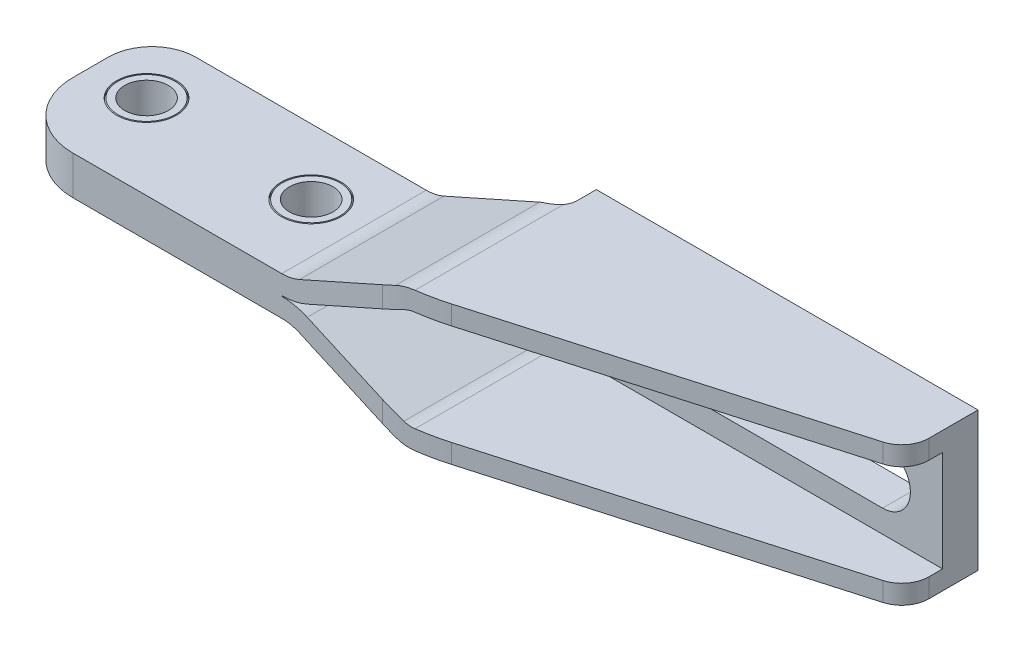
ISO-10303-21;
HEADER;
FILE_DESCRIPTION(('STEP AP214'),'2;1');
FILE_NAME('part.step','',(''),(''),'','','');
FILE_SCHEMA(('AUTOMOTIVE_DESIGN { 1 0 10303 214 1 1 1 1 }'));
ENDSEC;
DATA;
#1=APPLICATION_CONTEXT('core data for automotive mechanical design processes');
#2=APPLICATION_PROTOCOL_DEFINITION('international standard','automotive_design',2000,#1);
#3=PRODUCT_CONTEXT('',#1,'mechanical');
#4=PRODUCT('Part','Part','',(#3));
#5=PRODUCT_RELATED_PRODUCT_CATEGORY('part','',(#4));
#6=PRODUCT_DEFINITION_FORMATION('','',#4);
#7=PRODUCT_DEFINITION_CONTEXT('part definition',#1,'design');
#8=PRODUCT_DEFINITION('design','',#6,#7);
#9=PRODUCT_DEFINITION_SHAPE('','',#8);
#10=(LENGTH_UNIT() NAMED_UNIT(*) SI_UNIT(.MILLI.,.METRE.));
#11=(NAMED_UNIT(*) PLANE_ANGLE_UNIT() SI_UNIT($,.RADIAN.));
#12=(NAMED_UNIT(*) SI_UNIT($,.STERADIAN.) SOLID_ANGLE_UNIT());
#13=UNCERTAINTY_MEASURE_WITH_UNIT(LENGTH_MEASURE(1.E-05),#10,'distance_accuracy_value','');
#14=(GEOMETRIC_REPRESENTATION_CONTEXT(3) GLOBAL_UNCERTAINTY_ASSIGNED_CONTEXT((#13)) GLOBAL_UNIT_ASSIGNED_CONTEXT((#10,
#11,#12)) REPRESENTATION_CONTEXT('',''));
#15=CARTESIAN_POINT('',(0.,0.,0.));
#16=DIRECTION('',(0.,0.,1.));
#17=DIRECTION('',(1.,0.,0.));
#18=AXIS2_PLACEMENT_3D('',#15,#16,#17);
#19=CARTESIAN_POINT('',(31.2,-3.65,1.));
#20=DIRECTION('',(0.,1.,0.));
#21=DIRECTION('',(1.,0.,0.));
#22=AXIS2_PLACEMENT_3D('',#19,#20,#21);
#23=CYLINDRICAL_SURFACE('',#22,4.);
#24=CARTESIAN_POINT('',(31.2,3.55,1.));
#25=DIRECTION('',(0.,-1.,0.));
#26=DIRECTION('',(1.,0.,0.));
#27=AXIS2_PLACEMENT_3D('',#24,#25,#26);
#28=CIRCLE('',#27,4.);
#29=CARTESIAN_POINT('',(35.2,3.55,1.));
#30=VERTEX_POINT('',#29);
#31=EDGE_CURVE('E1753',#30,#30,#28,.F.);
#32=ORIENTED_EDGE('',*,*,#31,.T.);
#33=EDGE_LOOP('',(#32));
#34=FACE_BOUND('',#33,.T.);
#35=CARTESIAN_POINT('',(31.2,-3.55,1.));
#36=DIRECTION('',(0.,1.,0.));
#37=DIRECTION('',(-1.,0.,0.));
#38=AXIS2_PLACEMENT_3D('',#35,#36,#37);
#39=CIRCLE('',#38,4.);
#40=CARTESIAN_POINT('',(27.2,-3.55,1.));
#41=VERTEX_POINT('',#40);
#42=EDGE_CURVE('E614',#41,#41,#39,.F.);
#43=ORIENTED_EDGE('',*,*,#42,.T.);
#44=EDGE_LOOP('',(#43));
#45=FACE_BOUND('',#44,.T.);
#46=ADVANCED_FACE('F14',(#34,#45),#23,.F.);
#47=CARTESIAN_POINT('',(31.2,-3.65,1.));
#48=DIRECTION('',(0.,1.,0.));
#49=DIRECTION('',(1.,0.,0.));
#50=AXIS2_PLACEMENT_3D('',#47,#48,#49);
#51=CONICAL_SURFACE('',#50,5.2113248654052,0.523598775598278);
#52=CARTESIAN_POINT('',(31.2,-3.55,1.));
#53=DIRECTION('',(0.,1.,0.));
#54=DIRECTION('',(-1.,0.,0.));
#55=AXIS2_PLACEMENT_3D('',#52,#53,#54);
#56=CIRCLE('',#55,5.26905989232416);
#57=CARTESIAN_POINT('',(25.9309401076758,-3.55,1.));
#58=VERTEX_POINT('',#57);
#59=EDGE_CURVE('E1749',#58,#58,#56,.T.);
#60=ORIENTED_EDGE('',*,*,#59,.T.);
#61=EDGE_LOOP('',(#60));
#62=FACE_BOUND('',#61,.T.);
#63=CARTESIAN_POINT('',(31.2,-3.15,1.));
#64=DIRECTION('',(0.,1.,0.));
#65=DIRECTION('',(1.,0.,0.));
#66=AXIS2_PLACEMENT_3D('',#63,#64,#65);
#67=CIRCLE('',#66,5.5);
#68=CARTESIAN_POINT('',(36.7,-3.15,1.));
#69=VERTEX_POINT('',#68);
#70=EDGE_CURVE('E9',#69,#69,#67,.T.);
#71=ORIENTED_EDGE('',*,*,#70,.F.);
#72=EDGE_LOOP('',(#71));
#73=FACE_BOUND('',#72,.T.);
#74=ADVANCED_FACE('F1596',(#62,#73),#51,.T.);
#75=CARTESIAN_POINT('',(31.2,3.15,1.));
#76=DIRECTION('',(0.,-1.,0.));
#77=DIRECTION('',(-1.,0.,0.));
#78=AXIS2_PLACEMENT_3D('',#75,#76,#77);
#79=CONICAL_SURFACE('',#78,5.5,0.523598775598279);
#80=CARTESIAN_POINT('',(31.2,3.55,1.));
#81=DIRECTION('',(0.,-1.,0.));
#82=DIRECTION('',(1.,0.,0.));
#83=AXIS2_PLACEMENT_3D('',#80,#81,#82);
#84=CIRCLE('',#83,5.26905989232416);
#85=CARTESIAN_POINT('',(36.4690598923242,3.55,1.));
#86=VERTEX_POINT('',#85);
#87=EDGE_CURVE('E1766',#86,#86,#84,.T.);
#88=ORIENTED_EDGE('',*,*,#87,.T.);
#89=EDGE_LOOP('',(#88));
#90=FACE_BOUND('',#89,.T.);
#91=CARTESIAN_POINT('',(31.2,3.15,1.));
#92=DIRECTION('',(0.,1.,0.));
#93=DIRECTION('',(1.,0.,0.));
#94=AXIS2_PLACEMENT_3D('',#91,#92,#93);
#95=CIRCLE('',#94,5.5);
#96=CARTESIAN_POINT('',(36.7,3.15,1.));
#97=VERTEX_POINT('',#96);
#98=EDGE_CURVE('E23',#97,#97,#95,.T.);
#99=ORIENTED_EDGE('',*,*,#98,.T.);
#100=EDGE_LOOP('',(#99));
#101=FACE_BOUND('',#100,.T.);
#102=ADVANCED_FACE('F828',(#90,#101),#79,.T.);
#103=CARTESIAN_POINT('',(0.,-3.65,0.));
#104=DIRECTION('',(0.,1.,0.));
#105=DIRECTION('',(1.,0.,0.));
#106=AXIS2_PLACEMENT_3D('',#103,#104,#105);
#107=CYLINDRICAL_SURFACE('',#106,4.);
#108=CARTESIAN_POINT('',(0.,3.55,0.));
#109=DIRECTION('',(0.,-1.,0.));
#110=DIRECTION('',(1.,0.,0.));
#111=AXIS2_PLACEMENT_3D('',#108,#109,#110);
#112=CIRCLE('',#111,4.);
#113=CARTESIAN_POINT('',(4.,3.55,0.));
#114=VERTEX_POINT('',#113);
#115=EDGE_CURVE('E1769',#114,#114,#112,.F.);
#116=ORIENTED_EDGE('',*,*,#115,.T.);
#117=EDGE_LOOP('',(#116));
#118=FACE_BOUND('',#117,.T.);
#119=CARTESIAN_POINT('',(0.,-3.55,0.));
#120=DIRECTION('',(0.,1.,0.));
#121=DIRECTION('',(-1.,0.,0.));
#122=AXIS2_PLACEMENT_3D('',#119,#120,#121);
#123=CIRCLE('',#122,4.);
#124=CARTESIAN_POINT('',(-4.,-3.55,0.));
#125=VERTEX_POINT('',#124);
#126=EDGE_CURVE('E1747',#125,#125,#123,.F.);
#127=ORIENTED_EDGE('',*,*,#126,.T.);
#128=EDGE_LOOP('',(#127));
#129=FACE_BOUND('',#128,.T.);
#130=ADVANCED_FACE('F819',(#118,#129),#107,.F.);
#131=CARTESIAN_POINT('',(124.,0.,-17.5));
#132=DIRECTION('',(0.,0.,1.));
#133=DIRECTION('',(0.,1.,0.));
#134=AXIS2_PLACEMENT_3D('',#131,#132,#133);
#135=CYLINDRICAL_SURFACE('',#134,5.1);
#136=CARTESIAN_POINT('',(124.,0.,-11.));
#137=DIRECTION('',(0.,0.,1.));
#138=DIRECTION('',(-1.,0.,0.));
#139=AXIS2_PLACEMENT_3D('',#136,#137,#138);
#140=CIRCLE('',#139,5.1);
#141=CARTESIAN_POINT('',(124.,-5.1,-11.));
#142=VERTEX_POINT('',#141);
#143=CARTESIAN_POINT('',(124.,5.1,-11.));
#144=VERTEX_POINT('',#143);
#145=EDGE_CURVE('E624',#142,#144,#140,.T.);
#146=ORIENTED_EDGE('',*,*,#145,.T.);
#147=DIRECTION('',(0.,0.,1.));
#148=VECTOR('',#147,1.);
#149=CARTESIAN_POINT('',(124.,5.1,-17.5));
#150=LINE('',#149,#148);
#151=CARTESIAN_POINT('',(124.,5.1,-17.5));
#152=VERTEX_POINT('',#151);
#153=EDGE_CURVE('E651',#152,#144,#150,.T.);
#154=ORIENTED_EDGE('',*,*,#153,.F.);
#155=CARTESIAN_POINT('',(124.,0.,-17.5));
#156=DIRECTION('',(0.,0.,1.));
#157=DIRECTION('',(-1.,0.,0.));
#158=AXIS2_PLACEMENT_3D('',#155,#156,#157);
#159=CIRCLE('',#158,5.1);
#160=CARTESIAN_POINT('',(124.,-5.1,-17.5));
#161=VERTEX_POINT('',#160);
#162=EDGE_CURVE('E637',#161,#152,#159,.T.);
#163=ORIENTED_EDGE('',*,*,#162,.F.);
#164=DIRECTION('',(0.,0.,1.));
#165=VECTOR('',#164,1.);
#166=CARTESIAN_POINT('',(124.,-5.1,-17.5));
#167=LINE('',#166,#165);
#168=EDGE_CURVE('E653',#161,#142,#167,.T.);
#169=ORIENTED_EDGE('',*,*,#168,.T.);
#170=EDGE_LOOP('',(#146,#154,#163,#169));
#171=FACE_BOUND('',#170,.T.);
#172=ADVANCED_FACE('F821',(#171),#135,.F.);
#173=CARTESIAN_POINT('',(124.,5.1,-17.5));
#174=DIRECTION('',(0.,1.,0.));
#175=DIRECTION('',(-1.,0.,0.));
#176=AXIS2_PLACEMENT_3D('',#173,#174,#175);
#177=PLANE('',#176);
#178=DIRECTION('',(-1.,0.,0.));
#179=VECTOR('',#178,1.);
#180=CARTESIAN_POINT('',(124.,5.1,-11.));
#181=LINE('',#180,#179);
#182=CARTESIAN_POINT('',(76.,5.1,-11.));
#183=VERTEX_POINT('',#182);
#184=EDGE_CURVE('E39',#144,#183,#181,.T.);
#185=ORIENTED_EDGE('',*,*,#184,.T.);
#186=DIRECTION('',(0.,0.,1.));
#187=VECTOR('',#186,1.);
#188=CARTESIAN_POINT('',(76.,5.1,-17.5));
#189=LINE('',#188,#187);
#190=CARTESIAN_POINT('',(76.,5.1,-17.5));
#191=VERTEX_POINT('',#190);
#192=EDGE_CURVE('E649',#191,#183,#189,.T.);
#193=ORIENTED_EDGE('',*,*,#192,.F.);
#194=DIRECTION('',(-1.,0.,0.));
#195=VECTOR('',#194,1.);
#196=CARTESIAN_POINT('',(124.,5.1,-17.5));
#197=LINE('',#196,#195);
#198=EDGE_CURVE('E640',#152,#191,#197,.T.);
#199=ORIENTED_EDGE('',*,*,#198,.F.);
#200=ORIENTED_EDGE('',*,*,#153,.T.);
#201=EDGE_LOOP('',(#185,#193,#199,#200));
#202=FACE_BOUND('',#201,.T.);
#203=ADVANCED_FACE('F817',(#202),#177,.F.);
#204=CARTESIAN_POINT('',(76.,0.,-17.5));
#205=DIRECTION('',(0.,0.,1.));
#206=DIRECTION('',(0.,1.,0.));
#207=AXIS2_PLACEMENT_3D('',#204,#205,#206);
#208=CYLINDRICAL_SURFACE('',#207,5.1);
#209=CARTESIAN_POINT('',(76.,0.,-11.));
#210=DIRECTION('',(0.,0.,1.));
#211=DIRECTION('',(1.,0.,0.));
#212=AXIS2_PLACEMENT_3D('',#209,#210,#211);
#213=CIRCLE('',#212,5.1);
#214=CARTESIAN_POINT('',(76.,-5.1,-11.));
#215=VERTEX_POINT('',#214);
#216=EDGE_CURVE('E630',#183,#215,#213,.T.);
#217=ORIENTED_EDGE('',*,*,#216,.T.);
#218=DIRECTION('',(0.,0.,1.));
#219=VECTOR('',#218,1.);
#220=CARTESIAN_POINT('',(76.,-5.1,-17.5));
#221=LINE('',#220,#219);
#222=CARTESIAN_POINT('',(76.,-5.1,-17.5));
#223=VERTEX_POINT('',#222);
#224=EDGE_CURVE('E646',#223,#215,#221,.T.);
#225=ORIENTED_EDGE('',*,*,#224,.F.);
#226=CARTESIAN_POINT('',(76.,0.,-17.5));
#227=DIRECTION('',(0.,0.,1.));
#228=DIRECTION('',(1.,0.,0.));
#229=AXIS2_PLACEMENT_3D('',#226,#227,#228);
#230=CIRCLE('',#229,5.1);
#231=EDGE_CURVE('E643',#191,#223,#230,.T.);
#232=ORIENTED_EDGE('',*,*,#231,.F.);
#233=ORIENTED_EDGE('',*,*,#192,.T.);
#234=EDGE_LOOP('',(#217,#225,#232,#233));
#235=FACE_BOUND('',#234,.T.);
#236=ADVANCED_FACE('F814',(#235),#208,.F.);
#237=CARTESIAN_POINT('',(76.,-5.1,-17.5));
#238=DIRECTION('',(0.,-1.,0.));
#239=DIRECTION('',(1.,0.,0.));
#240=AXIS2_PLACEMENT_3D('',#237,#238,#239);
#241=PLANE('',#240);
#242=DIRECTION('',(1.,0.,0.));
#243=VECTOR('',#242,1.);
#244=CARTESIAN_POINT('',(76.,-5.1,-11.));
#245=LINE('',#244,#243);
#246=EDGE_CURVE('E623',#215,#142,#245,.T.);
#247=ORIENTED_EDGE('',*,*,#246,.T.);
#248=ORIENTED_EDGE('',*,*,#168,.F.);
#249=DIRECTION('',(1.,0.,0.));
#250=VECTOR('',#249,1.);
#251=CARTESIAN_POINT('',(76.,-5.1,-17.5));
#252=LINE('',#251,#250);
#253=EDGE_CURVE('E31',#223,#161,#252,.T.);
#254=ORIENTED_EDGE('',*,*,#253,.F.);
#255=ORIENTED_EDGE('',*,*,#224,.T.);
#256=EDGE_LOOP('',(#247,#248,#254,#255));
#257=FACE_BOUND('',#256,.T.);
#258=ADVANCED_FACE('F447',(#257),#241,.F.);
#259=CARTESIAN_POINT('',(130.000000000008,-12.75,-8.49999999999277));
#260=DIRECTION('',(0.,1.,0.));
#261=DIRECTION('',(-1.,0.,0.));
#262=AXIS2_PLACEMENT_3D('',#259,#260,#261);
#263=CYLINDRICAL_SURFACE('',#262,4.99999999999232);
#264=DIRECTION('',(0.,1.,0.));
#265=VECTOR('',#264,1.);
#266=CARTESIAN_POINT('',(131.37818677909,-12.75,-3.6936915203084));
#267=LINE('',#266,#265);
#268=CARTESIAN_POINT('',(131.37818677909,9.25,-3.6936915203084));
#269=VERTEX_POINT('',#268);
#270=CARTESIAN_POINT('',(131.37818677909,12.75,-3.6936915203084));
#271=VERTEX_POINT('',#270);
#272=EDGE_CURVE('E492',#269,#271,#267,.T.);
#273=ORIENTED_EDGE('',*,*,#272,.F.);
#274=CARTESIAN_POINT('',(130.000000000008,9.25,-8.49999999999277));
#275=DIRECTION('',(0.,-1.,0.));
#276=DIRECTION('',(1.,0.,0.));
#277=AXIS2_PLACEMENT_3D('',#274,#275,#276);
#278=CIRCLE('',#277,4.99999999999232);
#279=CARTESIAN_POINT('',(135.,9.25,-8.5));
#280=VERTEX_POINT('',#279);
#281=EDGE_CURVE('E547',#269,#280,#278,.F.);
#282=ORIENTED_EDGE('',*,*,#281,.T.);
#283=DIRECTION('',(0.,1.,0.));
#284=VECTOR('',#283,1.);
#285=CARTESIAN_POINT('',(135.,-12.75,-8.5));
#286=LINE('',#285,#284);
#287=CARTESIAN_POINT('',(135.,12.75,-8.5));
#288=VERTEX_POINT('',#287);
#289=EDGE_CURVE('E482',#280,#288,#286,.T.);
#290=ORIENTED_EDGE('',*,*,#289,.T.);
#291=CARTESIAN_POINT('',(130.000000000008,12.75,-8.49999999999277));
#292=DIRECTION('',(0.,1.,0.));
#293=DIRECTION('',(-1.,0.,0.));
#294=AXIS2_PLACEMENT_3D('',#291,#292,#293);
#295=CIRCLE('',#294,4.99999999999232);
#296=EDGE_CURVE('E694',#271,#288,#295,.T.);
#297=ORIENTED_EDGE('',*,*,#296,.F.);
#298=EDGE_LOOP('',(#273,#282,#290,#297));
#299=FACE_BOUND('',#298,.T.);
#300=ADVANCED_FACE('F414',(#299),#263,.T.);
#301=CARTESIAN_POINT('',(135.,-12.75,-17.5));
#302=DIRECTION('',(0.,0.,-1.));
#303=DIRECTION('',(0.,-1.,0.));
#304=AXIS2_PLACEMENT_3D('',#301,#302,#303);
#305=PLANE('',#304);
#306=ORIENTED_EDGE('',*,*,#253,.T.);
#307=ORIENTED_EDGE('',*,*,#162,.T.);
#308=ORIENTED_EDGE('',*,*,#198,.T.);
#309=ORIENTED_EDGE('',*,*,#231,.T.);
#310=EDGE_LOOP('',(#306,#307,#308,#309));
#311=FACE_BOUND('',#310,.T.);
#312=DIRECTION('',(0.,1.,0.));
#313=VECTOR('',#312,1.);
#314=CARTESIAN_POINT('',(65.,-12.75,-17.5));
#315=LINE('',#314,#313);
#316=CARTESIAN_POINT('',(65.,-12.75,-17.5));
#317=VERTEX_POINT('',#316);
#318=CARTESIAN_POINT('',(65.,12.75,-17.5));
#319=VERTEX_POINT('',#318);
#320=EDGE_CURVE('E526',#317,#319,#315,.T.);
#321=ORIENTED_EDGE('',*,*,#320,.T.);
#322=DIRECTION('',(-1.,0.,0.));
#323=VECTOR('',#322,1.);
#324=CARTESIAN_POINT('',(135.,12.75,-17.5));
#325=LINE('',#324,#323);
#326=CARTESIAN_POINT('',(135.,12.75,-17.5));
#327=VERTEX_POINT('',#326);
#328=EDGE_CURVE('E692',#327,#319,#325,.T.);
#329=ORIENTED_EDGE('',*,*,#328,.F.);
#330=DIRECTION('',(0.,1.,0.));
#331=VECTOR('',#330,1.);
#332=CARTESIAN_POINT('',(135.,-12.75,-17.5));
#333=LINE('',#332,#331);
#334=CARTESIAN_POINT('',(135.,-12.75,-17.5));
#335=VERTEX_POINT('',#334);
#336=EDGE_CURVE('E528',#335,#327,#333,.T.);
#337=ORIENTED_EDGE('',*,*,#336,.F.);
#338=DIRECTION('',(-1.,0.,0.));
#339=VECTOR('',#338,1.);
#340=CARTESIAN_POINT('',(135.,-12.75,-17.5));
#341=LINE('',#340,#339);
#342=EDGE_CURVE('E688',#335,#317,#341,.T.);
#343=ORIENTED_EDGE('',*,*,#342,.T.);
#344=EDGE_LOOP('',(#321,#329,#337,#343));
#345=FACE_BOUND('',#344,.T.);
#346=ADVANCED_FACE('F754',(#311,#345),#305,.T.);
#347=CARTESIAN_POINT('',(64.3600000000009,4.74999999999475,-11.));
#348=DIRECTION('',(0.,0.,1.));
#349=DIRECTION('',(0.,1.,0.));
#350=AXIS2_PLACEMENT_3D('',#347,#348,#349);
#351=PLANE('',#350);
#352=ORIENTED_EDGE('',*,*,#246,.F.);
#353=ORIENTED_EDGE('',*,*,#216,.F.);
#354=ORIENTED_EDGE('',*,*,#184,.F.);
#355=ORIENTED_EDGE('',*,*,#145,.F.);
#356=EDGE_LOOP('',(#352,#353,#354,#355));
#357=FACE_BOUND('',#356,.T.);
#358=DIRECTION('',(0.,1.,0.));
#359=VECTOR('',#358,1.);
#360=CARTESIAN_POINT('',(65.,-9.25,-11.));
#361=LINE('',#360,#359);
#362=CARTESIAN_POINT('',(65.,-9.25,-11.));
#363=VERTEX_POINT('',#362);
#364=CARTESIAN_POINT('',(65.,9.25,-11.));
#365=VERTEX_POINT('',#364);
#366=EDGE_CURVE('E470',#363,#365,#361,.T.);
#367=ORIENTED_EDGE('',*,*,#366,.F.);
#368=DIRECTION('',(1.,0.,0.));
#369=VECTOR('',#368,1.);
#370=CARTESIAN_POINT('',(64.36,-9.25,-11.));
#371=LINE('',#370,#369);
#372=CARTESIAN_POINT('',(135.,-9.25,-11.));
#373=VERTEX_POINT('',#372);
#374=EDGE_CURVE('E317',#363,#373,#371,.T.);
#375=ORIENTED_EDGE('',*,*,#374,.T.);
#376=DIRECTION('',(0.,-1.,0.));
#377=VECTOR('',#376,1.);
#378=CARTESIAN_POINT('',(135.,-12.75,-11.));
#379=LINE('',#378,#377);
#380=CARTESIAN_POINT('',(135.,9.25,-11.));
#381=VERTEX_POINT('',#380);
#382=EDGE_CURVE('E473',#381,#373,#379,.T.);
#383=ORIENTED_EDGE('',*,*,#382,.F.);
#384=DIRECTION('',(-1.,0.,0.));
#385=VECTOR('',#384,1.);
#386=CARTESIAN_POINT('',(140.,9.25,-11.));
#387=LINE('',#386,#385);
#388=EDGE_CURVE('E309',#381,#365,#387,.T.);
#389=ORIENTED_EDGE('',*,*,#388,.T.);
#390=EDGE_LOOP('',(#367,#375,#383,#389));
#391=FACE_BOUND('',#390,.T.);
#392=ADVANCED_FACE('F389',(#357,#391),#351,.T.);
#393=CARTESIAN_POINT('',(135.,-12.75,-8.5));
#394=DIRECTION('',(1.,0.,0.));
#395=DIRECTION('',(0.,1.,0.));
#396=AXIS2_PLACEMENT_3D('',#393,#394,#395);
#397=PLANE('',#396);
#398=ORIENTED_EDGE('',*,*,#382,.T.);
#399=DIRECTION('',(0.,0.,1.));
#400=VECTOR('',#399,1.);
#401=CARTESIAN_POINT('',(135.,-9.25,-8.5));
#402=LINE('',#401,#400);
#403=CARTESIAN_POINT('',(135.,-9.25,-8.5));
#404=VERTEX_POINT('',#403);
#405=EDGE_CURVE('E344',#373,#404,#402,.T.);
#406=ORIENTED_EDGE('',*,*,#405,.T.);
#407=CARTESIAN_POINT('',(135.,-12.75,-8.5));
#408=VERTEX_POINT('',#407);
#409=EDGE_CURVE('E488',#408,#404,#286,.T.);
#410=ORIENTED_EDGE('',*,*,#409,.F.);
#411=DIRECTION('',(0.,0.,-1.));
#412=VECTOR('',#411,1.);
#413=CARTESIAN_POINT('',(135.,-12.75,-8.5));
#414=LINE('',#413,#412);
#415=EDGE_CURVE('E498',#408,#335,#414,.T.);
#416=ORIENTED_EDGE('',*,*,#415,.T.);
#417=ORIENTED_EDGE('',*,*,#336,.T.);
#418=DIRECTION('',(0.,0.,-1.));
#419=VECTOR('',#418,1.);
#420=CARTESIAN_POINT('',(135.,12.75,-8.5));
#421=LINE('',#420,#419);
#422=EDGE_CURVE('E484',#288,#327,#421,.T.);
#423=ORIENTED_EDGE('',*,*,#422,.F.);
#424=ORIENTED_EDGE('',*,*,#289,.F.);
#425=DIRECTION('',(0.,0.,-1.));
#426=VECTOR('',#425,1.);
#427=CARTESIAN_POINT('',(135.,9.25,-8.5));
#428=LINE('',#427,#426);
#429=EDGE_CURVE('E335',#280,#381,#428,.T.);
#430=ORIENTED_EDGE('',*,*,#429,.T.);
#431=EDGE_LOOP('',(#398,#406,#410,#416,#417,#423,#424,#430));
#432=FACE_BOUND('',#431,.T.);
#433=ADVANCED_FACE('F16',(#432),#397,.T.);
#434=ORIENTED_EDGE('',*,*,#409,.T.);
#435=CARTESIAN_POINT('',(130.000000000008,-9.25,-8.49999999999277));
#436=DIRECTION('',(0.,1.,0.));
#437=DIRECTION('',(-1.,0.,0.));
#438=AXIS2_PLACEMENT_3D('',#435,#436,#437);
#439=CIRCLE('',#438,4.99999999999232);
#440=CARTESIAN_POINT('',(131.37818677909,-9.25,-3.6936915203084));
#441=VERTEX_POINT('',#440);
#442=EDGE_CURVE('E549',#404,#441,#439,.F.);
#443=ORIENTED_EDGE('',*,*,#442,.T.);
#444=CARTESIAN_POINT('',(131.37818677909,-12.75,-3.6936915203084));
#445=VERTEX_POINT('',#444);
#446=EDGE_CURVE('E499',#445,#441,#267,.T.);
#447=ORIENTED_EDGE('',*,*,#446,.F.);
#448=CARTESIAN_POINT('',(130.000000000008,-12.75,-8.49999999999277));
#449=DIRECTION('',(0.,1.,0.));
#450=DIRECTION('',(-1.,0.,0.));
#451=AXIS2_PLACEMENT_3D('',#448,#449,#450);
#452=CIRCLE('',#451,4.99999999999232);
#453=EDGE_CURVE('E489',#445,#408,#452,.T.);
#454=ORIENTED_EDGE('',*,*,#453,.T.);
#455=EDGE_LOOP('',(#434,#443,#447,#454));
#456=FACE_BOUND('',#455,.T.);
#457=ADVANCED_FACE('F755',(#456),#263,.T.);
#458=CARTESIAN_POINT('',(0.,3.15,0.));
#459=DIRECTION('',(0.,-1.,0.));
#460=DIRECTION('',(-1.,0.,0.));
#461=AXIS2_PLACEMENT_3D('',#458,#459,#460);
#462=CONICAL_SURFACE('',#461,5.5,0.523598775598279);
#463=CARTESIAN_POINT('',(0.,3.55,0.));
#464=DIRECTION('',(0.,-1.,0.));
#465=DIRECTION('',(1.,0.,0.));
#466=AXIS2_PLACEMENT_3D('',#463,#464,#465);
#467=CIRCLE('',#466,5.26905989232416);
#468=CARTESIAN_POINT('',(5.26905989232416,3.55,0.));
#469=VERTEX_POINT('',#468);
#470=EDGE_CURVE('E283',#469,#469,#467,.T.);
#471=ORIENTED_EDGE('',*,*,#470,.T.);
#472=EDGE_LOOP('',(#471));
#473=FACE_BOUND('',#472,.T.);
#474=CARTESIAN_POINT('',(0.,3.15,0.));
#475=DIRECTION('',(0.,1.,0.));
#476=DIRECTION('',(1.,0.,0.));
#477=AXIS2_PLACEMENT_3D('',#474,#475,#476);
#478=CIRCLE('',#477,5.5);
#479=CARTESIAN_POINT('',(5.5,3.15,0.));
#480=VERTEX_POINT('',#479);
#481=EDGE_CURVE('E600',#480,#480,#478,.T.);
#482=ORIENTED_EDGE('',*,*,#481,.T.);
#483=EDGE_LOOP('',(#482));
#484=FACE_BOUND('',#483,.T.);
#485=ADVANCED_FACE('F757',(#473,#484),#462,.T.);
#486=CARTESIAN_POINT('',(69.845690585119,-12.75,13.950467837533));
#487=DIRECTION('',(0.275637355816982,0.,0.961261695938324));
#488=DIRECTION('',(0.961261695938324,0.,-0.275637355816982));
#489=AXIS2_PLACEMENT_3D('',#486,#487,#488);
#490=PLANE('',#489);
#491=DIRECTION('',(0.,1.,0.));
#492=VECTOR('',#491,1.);
#493=CARTESIAN_POINT('',(69.845690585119,-12.75,13.950467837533));
#494=LINE('',#493,#492);
#495=CARTESIAN_POINT('',(69.845690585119,9.25,13.950467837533));
#496=VERTEX_POINT('',#495);
#497=CARTESIAN_POINT('',(69.845690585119,12.75,13.950467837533));
#498=VERTEX_POINT('',#497);
#499=EDGE_CURVE('E502',#496,#498,#494,.T.);
#500=ORIENTED_EDGE('',*,*,#499,.F.);
#501=DIRECTION('',(0.961261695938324,0.,-0.275637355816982));
#502=VECTOR('',#501,1.);
#503=CARTESIAN_POINT('',(69.845690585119,9.25,13.950467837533));
#504=LINE('',#503,#502);
#505=EDGE_CURVE('E332',#496,#269,#504,.T.);
#506=ORIENTED_EDGE('',*,*,#505,.T.);
#507=ORIENTED_EDGE('',*,*,#272,.T.);
#508=DIRECTION('',(0.961261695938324,0.,-0.275637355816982));
#509=VECTOR('',#508,1.);
#510=CARTESIAN_POINT('',(69.845690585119,12.75,13.950467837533));
#511=LINE('',#510,#509);
#512=EDGE_CURVE('E696',#498,#271,#511,.T.);
#513=ORIENTED_EDGE('',*,*,#512,.F.);
#514=EDGE_LOOP('',(#500,#506,#507,#513));
#515=FACE_BOUND('',#514,.T.);
#516=ADVANCED_FACE('F750',(#515),#490,.T.);
#517=CARTESIAN_POINT('',(62.0000000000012,12.75,-13.9999999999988));
#518=DIRECTION('',(0.,-1.,0.));
#519=DIRECTION('',(1.,0.,0.));
#520=AXIS2_PLACEMENT_3D('',#517,#518,#519);
#521=PLANE('',#520);
#522=DIRECTION('',(0.,0.,-1.));
#523=VECTOR('',#522,1.);
#524=CARTESIAN_POINT('',(64.36,12.75,17.5));
#525=LINE('',#524,#523);
#526=CARTESIAN_POINT('',(64.359999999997,12.75,15.1145248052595));
#527=VERTEX_POINT('',#526);
#528=CARTESIAN_POINT('',(64.36,12.75,-12.147866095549));
#529=VERTEX_POINT('',#528);
#530=EDGE_CURVE('E356',#527,#529,#525,.T.);
#531=ORIENTED_EDGE('',*,*,#530,.F.);
#532=CARTESIAN_POINT('',(58.8201963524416,12.75,-24.4999999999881));
#533=DIRECTION('',(0.,1.,0.));
#534=DIRECTION('',(-1.,0.,0.));
#535=AXIS2_PLACEMENT_3D('',#532,#533,#534);
#536=CIRCLE('',#535,39.9999999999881);
#537=EDGE_CURVE('E699',#527,#498,#536,.T.);
#538=ORIENTED_EDGE('',*,*,#537,.T.);
#539=ORIENTED_EDGE('',*,*,#512,.T.);
#540=ORIENTED_EDGE('',*,*,#296,.T.);
#541=ORIENTED_EDGE('',*,*,#422,.T.);
#542=ORIENTED_EDGE('',*,*,#328,.T.);
#543=DIRECTION('',(0.,0.,1.));
#544=VECTOR('',#543,1.);
#545=CARTESIAN_POINT('',(65.,12.75,-17.5));
#546=LINE('',#545,#544);
#547=CARTESIAN_POINT('',(65.,12.75,-14.));
#548=VERTEX_POINT('',#547);
#549=EDGE_CURVE('E705',#319,#548,#546,.T.);
#550=ORIENTED_EDGE('',*,*,#549,.T.);
#551=CARTESIAN_POINT('',(62.0000000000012,12.75,-13.9999999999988));
#552=DIRECTION('',(0.,-1.,0.));
#553=DIRECTION('',(-1.,0.,0.));
#554=AXIS2_PLACEMENT_3D('',#551,#552,#553);
#555=CIRCLE('',#554,2.99999999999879);
#556=EDGE_CURVE('E702',#548,#529,#555,.T.);
#557=ORIENTED_EDGE('',*,*,#556,.T.);
#558=EDGE_LOOP('',(#531,#538,#539,#540,#541,#542,#550,#557));
#559=FACE_BOUND('',#558,.T.);
#560=ADVANCED_FACE('F413',(#559),#521,.F.);
#561=CARTESIAN_POINT('',(64.3600000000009,4.74999999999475,25.5));
#562=DIRECTION('',(0.,0.,-1.));
#563=DIRECTION('',(0.,-1.,0.));
#564=AXIS2_PLACEMENT_3D('',#561,#562,#563);
#565=CYLINDRICAL_SURFACE('',#564,4.50000000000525);
#566=DIRECTION('',(0.,0.,-1.));
#567=VECTOR('',#566,1.);
#568=CARTESIAN_POINT('',(62.529298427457,8.8607823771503,25.5));
#569=LINE('',#568,#567);
#570=CARTESIAN_POINT('',(62.529298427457,8.8607823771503,15.3276607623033));
#571=VERTEX_POINT('',#570);
#572=CARTESIAN_POINT('',(62.529298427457,8.8607823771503,-11.0470619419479));
#573=VERTEX_POINT('',#572);
#574=EDGE_CURVE('E328',#571,#573,#569,.T.);
#575=ORIENTED_EDGE('',*,*,#574,.T.);
#576=CARTESIAN_POINT('',(62.529298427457,8.8607823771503,-11.0470619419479));
#577=CARTESIAN_POINT('',(62.5966333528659,8.89078564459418,-11.0591176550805));
#578=CARTESIAN_POINT('',(62.6643547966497,8.91894607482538,-11.0736470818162));
#579=CARTESIAN_POINT('',(62.7999663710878,8.97155780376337,-11.1077823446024));
#580=CARTESIAN_POINT('',(62.8678565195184,8.99600869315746,-11.1273887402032));
#581=CARTESIAN_POINT('',(63.0029798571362,9.04110244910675,-11.1717366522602));
#582=CARTESIAN_POINT('',(63.070214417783,9.06175669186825,-11.1964623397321));
#583=CARTESIAN_POINT('',(63.2035707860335,9.09942297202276,-11.251069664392));
#584=CARTESIAN_POINT('',(63.2696927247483,9.11643544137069,-11.2809506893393));
#585=CARTESIAN_POINT('',(63.4656613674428,9.16226748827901,-11.3783467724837));
#586=CARTESIAN_POINT('',(63.5930130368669,9.18584998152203,-11.4535832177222));
#587=CARTESIAN_POINT('',(63.8361521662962,9.22109929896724,-11.6229194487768));
#588=CARTESIAN_POINT('',(63.9519437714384,9.23277040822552,-11.7170124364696));
#589=CARTESIAN_POINT('',(64.1141338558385,9.2436051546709,-11.8702178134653));
#590=CARTESIAN_POINT('',(64.1662241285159,9.24610575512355,-11.9232248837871));
#591=CARTESIAN_POINT('',(64.2662554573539,9.24930040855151,-12.0328754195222));
#592=CARTESIAN_POINT('',(64.3142046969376,9.24999810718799,-12.0895113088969));
#593=CARTESIAN_POINT('',(64.36,9.25,-12.1478660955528));
#594=B_SPLINE_CURVE_WITH_KNOTS('',3,(#576,#577,#578,#579,#580,#581,#582,#583,#584,#585,#586,
#587,#588,#589,#590,#591,#592,#593),.UNSPECIFIED.,.F.,.F.,(4,2,2,2,2,2,2,2,4),(0.,
0.224035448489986,0.448095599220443,0.671473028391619,0.89482394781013,1.34184434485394,
1.78870387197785,2.01158760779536,2.23402029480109),.UNSPECIFIED.);
#595=CARTESIAN_POINT('',(64.36,9.25,-12.1478660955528));
#596=VERTEX_POINT('',#595);
#597=EDGE_CURVE('E452',#573,#596,#594,.T.);
#598=ORIENTED_EDGE('',*,*,#597,.T.);
#599=DIRECTION('',(0.,0.,-1.));
#600=VECTOR('',#599,1.);
#601=CARTESIAN_POINT('',(64.36,9.25,25.5));
#602=LINE('',#601,#600);
#603=CARTESIAN_POINT('',(64.36,9.25,15.1145248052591));
#604=VERTEX_POINT('',#603);
#605=EDGE_CURVE('E330',#604,#596,#602,.T.);
#606=ORIENTED_EDGE('',*,*,#605,.F.);
#607=CARTESIAN_POINT('',(62.529298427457,8.8607823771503,15.3276607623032));
#608=CARTESIAN_POINT('',(62.6459615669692,8.91275444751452,15.3168014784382));
#609=CARTESIAN_POINT('',(62.764791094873,8.95970605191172,15.3052128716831));
#610=CARTESIAN_POINT('',(63.0059311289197,9.04333814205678,15.2805756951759));
#611=CARTESIAN_POINT('',(63.1282433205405,9.08001355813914,15.2675264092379));
#612=CARTESIAN_POINT('',(63.3732464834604,9.14226922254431,15.2402151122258));
#613=CARTESIAN_POINT('',(63.4958944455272,9.16803011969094,15.2259779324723));
#614=CARTESIAN_POINT('',(63.7426852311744,9.2092100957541,15.1961525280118));
#615=CARTESIAN_POINT('',(63.8668270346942,9.22463586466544,15.1805651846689));
#616=CARTESIAN_POINT('',(64.0525095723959,9.23990286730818,15.1563578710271));
#617=CARTESIAN_POINT('',(64.1138133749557,9.2436802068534,15.1482212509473));
#618=CARTESIAN_POINT('',(64.2367489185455,9.24873414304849,15.1316139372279));
#619=CARTESIAN_POINT('',(64.2983809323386,9.24999986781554,15.1231419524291));
#620=CARTESIAN_POINT('',(64.36,9.25,15.1145248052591));
#621=B_SPLINE_CURVE_WITH_KNOTS('',3,(#607,#608,#609,#610,#611,#612,#613,#614,#615,#616,#617,
#618,#619,#620),.UNSPECIFIED.,.F.,.F.,(4,2,2,2,2,2,4),(0.,0.384412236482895,0.76901378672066,
1.14697429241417,1.52468990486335,1.71051561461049,1.89714395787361),.UNSPECIFIED.);
#622=EDGE_CURVE('E590',#571,#604,#621,.T.);
#623=ORIENTED_EDGE('',*,*,#622,.F.);
#624=EDGE_LOOP('',(#575,#598,#606,#623));
#625=FACE_BOUND('',#624,.T.);
#626=ADVANCED_FACE('F585',(#625),#565,.F.);
#627=CARTESIAN_POINT('',(140.,9.25,25.5));
#628=DIRECTION('',(0.,-1.,0.));
#629=DIRECTION('',(1.,0.,0.));
#630=AXIS2_PLACEMENT_3D('',#627,#628,#629);
#631=PLANE('',#630);
#632=ORIENTED_EDGE('',*,*,#605,.T.);
#633=CARTESIAN_POINT('',(62.0000000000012,9.25,-13.9999999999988));
#634=DIRECTION('',(0.,1.,0.));
#635=DIRECTION('',(-1.,0.,0.));
#636=AXIS2_PLACEMENT_3D('',#633,#634,#635);
#637=CIRCLE('',#636,2.99999999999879);
#638=CARTESIAN_POINT('',(65.,9.25,-14.));
#639=VERTEX_POINT('',#638);
#640=EDGE_CURVE('E459',#596,#639,#637,.T.);
#641=ORIENTED_EDGE('',*,*,#640,.T.);
#642=DIRECTION('',(0.,0.,1.));
#643=VECTOR('',#642,1.);
#644=CARTESIAN_POINT('',(65.,9.25,-28.5));
#645=LINE('',#644,#643);
#646=EDGE_CURVE('E478',#639,#365,#645,.T.);
#647=ORIENTED_EDGE('',*,*,#646,.T.);
#648=ORIENTED_EDGE('',*,*,#388,.F.);
#649=ORIENTED_EDGE('',*,*,#429,.F.);
#650=ORIENTED_EDGE('',*,*,#281,.F.);
#651=ORIENTED_EDGE('',*,*,#505,.F.);
#652=CARTESIAN_POINT('',(58.8201963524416,9.25,-24.4999999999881));
#653=DIRECTION('',(0.,-1.,0.));
#654=DIRECTION('',(1.,0.,0.));
#655=AXIS2_PLACEMENT_3D('',#652,#653,#654);
#656=CIRCLE('',#655,39.9999999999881);
#657=EDGE_CURVE('E338',#604,#496,#656,.F.);
#658=ORIENTED_EDGE('',*,*,#657,.F.);
#659=EDGE_LOOP('',(#632,#641,#647,#648,#649,#650,#651,#658));
#660=FACE_BOUND('',#659,.T.);
#661=ADVANCED_FACE('F475',(#660),#631,.T.);
#662=CARTESIAN_POINT('',(0.,-3.65,0.));
#663=DIRECTION('',(0.,1.,0.));
#664=DIRECTION('',(1.,0.,0.));
#665=AXIS2_PLACEMENT_3D('',#662,#663,#664);
#666=CONICAL_SURFACE('',#665,5.2113248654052,0.523598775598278);
#667=CARTESIAN_POINT('',(0.,-3.55,0.));
#668=DIRECTION('',(0.,1.,0.));
#669=DIRECTION('',(-1.,0.,0.));
#670=AXIS2_PLACEMENT_3D('',#667,#668,#669);
#671=CIRCLE('',#670,5.26905989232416);
#672=CARTESIAN_POINT('',(-5.26905989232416,-3.55,0.));
#673=VERTEX_POINT('',#672);
#674=EDGE_CURVE('E1744',#673,#673,#671,.T.);
#675=ORIENTED_EDGE('',*,*,#674,.T.);
#676=EDGE_LOOP('',(#675));
#677=FACE_BOUND('',#676,.T.);
#678=CARTESIAN_POINT('',(0.,-3.15,0.));
#679=DIRECTION('',(0.,1.,0.));
#680=DIRECTION('',(1.,0.,0.));
#681=AXIS2_PLACEMENT_3D('',#678,#679,#680);
#682=CIRCLE('',#681,5.5);
#683=CARTESIAN_POINT('',(5.5,-3.15,0.));
#684=VERTEX_POINT('',#683);
#685=EDGE_CURVE('E602',#684,#684,#682,.T.);
#686=ORIENTED_EDGE('',*,*,#685,.F.);
#687=EDGE_LOOP('',(#686));
#688=FACE_BOUND('',#687,.T.);
#689=ADVANCED_FACE('F1446',(#677,#688),#666,.T.);
#690=CARTESIAN_POINT('',(65.,-12.75,-17.5));
#691=DIRECTION('',(-1.,0.,0.));
#692=DIRECTION('',(0.,-1.,0.));
#693=AXIS2_PLACEMENT_3D('',#690,#691,#692);
#694=PLANE('',#693);
#695=ORIENTED_EDGE('',*,*,#549,.F.);
#696=ORIENTED_EDGE('',*,*,#320,.F.);
#697=DIRECTION('',(0.,0.,1.));
#698=VECTOR('',#697,1.);
#699=CARTESIAN_POINT('',(65.,-12.75,-17.5));
#700=LINE('',#699,#698);
#701=CARTESIAN_POINT('',(65.,-12.75,-14.));
#702=VERTEX_POINT('',#701);
#703=EDGE_CURVE('E686',#317,#702,#700,.T.);
#704=ORIENTED_EDGE('',*,*,#703,.T.);
#705=DIRECTION('',(0.,1.,0.));
#706=VECTOR('',#705,1.);
#707=CARTESIAN_POINT('',(65.,-12.75,-14.));
#708=LINE('',#707,#706);
#709=CARTESIAN_POINT('',(65.,-9.25,-14.));
#710=VERTEX_POINT('',#709);
#711=EDGE_CURVE('E523',#702,#710,#708,.T.);
#712=ORIENTED_EDGE('',*,*,#711,.T.);
#713=DIRECTION('',(0.,0.,1.));
#714=VECTOR('',#713,1.);
#715=CARTESIAN_POINT('',(65.,-9.25,-28.5));
#716=LINE('',#715,#714);
#717=EDGE_CURVE('E441',#710,#363,#716,.T.);
#718=ORIENTED_EDGE('',*,*,#717,.T.);
#719=ORIENTED_EDGE('',*,*,#366,.T.);
#720=ORIENTED_EDGE('',*,*,#646,.F.);
#721=EDGE_CURVE('E522',#639,#548,#708,.T.);
#722=ORIENTED_EDGE('',*,*,#721,.T.);
#723=EDGE_LOOP('',(#695,#696,#704,#712,#718,#719,#720,#722));
#724=FACE_BOUND('',#723,.T.);
#725=ADVANCED_FACE('F416',(#724),#694,.T.);
#726=CARTESIAN_POINT('',(62.0000000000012,-12.75,-13.9999999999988));
#727=DIRECTION('',(0.,-1.,0.));
#728=DIRECTION('',(1.,0.,0.));
#729=AXIS2_PLACEMENT_3D('',#726,#727,#728);
#730=PLANE('',#729);
#731=CARTESIAN_POINT('',(58.8201963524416,-12.75,-24.4999999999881));
#732=DIRECTION('',(0.,1.,0.));
#733=DIRECTION('',(-1.,0.,0.));
#734=AXIS2_PLACEMENT_3D('',#731,#732,#733);
#735=CIRCLE('',#734,39.9999999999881);
#736=CARTESIAN_POINT('',(64.36,-12.75,15.1145248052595));
#737=VERTEX_POINT('',#736);
#738=CARTESIAN_POINT('',(69.845690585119,-12.75,13.950467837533));
#739=VERTEX_POINT('',#738);
#740=EDGE_CURVE('E672',#737,#739,#735,.T.);
#741=ORIENTED_EDGE('',*,*,#740,.F.);
#742=DIRECTION('',(0.,0.,-1.));
#743=VECTOR('',#742,1.);
#744=CARTESIAN_POINT('',(64.36,-12.75,17.5));
#745=LINE('',#744,#743);
#746=CARTESIAN_POINT('',(64.359999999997,-12.75,-12.147866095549));
#747=VERTEX_POINT('',#746);
#748=EDGE_CURVE('E731',#737,#747,#745,.T.);
#749=ORIENTED_EDGE('',*,*,#748,.T.);
#750=CARTESIAN_POINT('',(62.0000000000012,-12.75,-13.9999999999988));
#751=DIRECTION('',(0.,-1.,0.));
#752=DIRECTION('',(-1.,0.,0.));
#753=AXIS2_PLACEMENT_3D('',#750,#751,#752);
#754=CIRCLE('',#753,2.99999999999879);
#755=EDGE_CURVE('E682',#702,#747,#754,.T.);
#756=ORIENTED_EDGE('',*,*,#755,.F.);
#757=ORIENTED_EDGE('',*,*,#703,.F.);
#758=ORIENTED_EDGE('',*,*,#342,.F.);
#759=ORIENTED_EDGE('',*,*,#415,.F.);
#760=ORIENTED_EDGE('',*,*,#453,.F.);
#761=DIRECTION('',(0.961261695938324,0.,-0.275637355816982));
#762=VECTOR('',#761,1.);
#763=CARTESIAN_POINT('',(69.845690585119,-12.75,13.950467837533));
#764=LINE('',#763,#762);
#765=EDGE_CURVE('E494',#739,#445,#764,.T.);
#766=ORIENTED_EDGE('',*,*,#765,.F.);
#767=EDGE_LOOP('',(#741,#749,#756,#757,#758,#759,#760,#766));
#768=FACE_BOUND('',#767,.T.);
#769=ADVANCED_FACE('F566',(#768),#730,.T.);
#770=CARTESIAN_POINT('',(64.3600000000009,-4.74999999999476,25.5));
#771=DIRECTION('',(0.,0.,-1.));
#772=DIRECTION('',(0.,-1.,0.));
#773=AXIS2_PLACEMENT_3D('',#770,#771,#772);
#774=CYLINDRICAL_SURFACE('',#773,4.50000000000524);
#775=DIRECTION('',(0.,0.,-1.));
#776=VECTOR('',#775,1.);
#777=CARTESIAN_POINT('',(64.36,-9.25,25.5));
#778=LINE('',#777,#776);
#779=CARTESIAN_POINT('',(64.36,-9.25,15.1145248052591));
#780=VERTEX_POINT('',#779);
#781=CARTESIAN_POINT('',(64.36,-9.25,-12.1478660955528));
#782=VERTEX_POINT('',#781);
#783=EDGE_CURVE('E316',#780,#782,#778,.T.);
#784=ORIENTED_EDGE('',*,*,#783,.T.);
#785=CARTESIAN_POINT('',(64.36,-9.25,-12.1478660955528));
#786=CARTESIAN_POINT('',(64.3126770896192,-9.2500006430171,-12.0875511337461));
#787=CARTESIAN_POINT('',(64.2630211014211,-9.24925364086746,-12.0290543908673));
#788=CARTESIAN_POINT('',(64.1593919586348,-9.24582512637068,-11.9160396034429));
#789=CARTESIAN_POINT('',(64.1054171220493,-9.24314285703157,-11.8615231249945));
#790=CARTESIAN_POINT('',(63.9934695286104,-9.23539924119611,-11.7567958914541));
#791=CARTESIAN_POINT('',(63.9354920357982,-9.23033503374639,-11.7065904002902));
#792=CARTESIAN_POINT('',(63.8160642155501,-9.21740863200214,-11.6109075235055));
#793=CARTESIAN_POINT('',(63.7546144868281,-9.20954691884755,-11.5654293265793));
#794=CARTESIAN_POINT('',(63.6285343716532,-9.19061201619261,-11.4793407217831));
#795=CARTESIAN_POINT('',(63.5638934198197,-9.17952746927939,-11.4387482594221));
#796=CARTESIAN_POINT('',(63.4322414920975,-9.15383481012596,-11.3628697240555));
#797=CARTESIAN_POINT('',(63.3652306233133,-9.139226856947,-11.3275834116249));
#798=CARTESIAN_POINT('',(63.2296477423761,-9.10627816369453,-11.2625546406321));
#799=CARTESIAN_POINT('',(63.1610794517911,-9.08794563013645,-11.2328002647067));
#800=CARTESIAN_POINT('',(63.022960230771,-9.0473832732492,-11.1788215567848));
#801=CARTESIAN_POINT('',(62.953409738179,-9.02515513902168,-11.154594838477));
#802=CARTESIAN_POINT('',(62.8245709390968,-8.98041059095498,-11.1148810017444));
#803=CARTESIAN_POINT('',(62.765324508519,-8.95844820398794,-11.0986258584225));
#804=CARTESIAN_POINT('',(62.6470553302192,-8.91171600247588,-11.0699778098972));
#805=CARTESIAN_POINT('',(62.5880324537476,-8.88694818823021,-11.0575821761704));
#806=CARTESIAN_POINT('',(62.529298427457,-8.8607823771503,-11.0470619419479));
#807=B_SPLINE_CURVE_WITH_KNOTS('',3,(#785,#786,#787,#788,#789,#790,#791,#792,#793,#794,#795,
#796,#797,#798,#799,#800,#801,#802,#803,#804,#805,#806),.UNSPECIFIED.,.F.,.F.,(4,2,2,2,2,2,2,2,
2,2,4),(0.,0.229946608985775,0.459983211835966,0.690296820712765,0.920570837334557,
1.15166639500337,1.38275152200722,1.61333290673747,1.8438145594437,2.0393727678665,
2.23479240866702),.UNSPECIFIED.);
#808=CARTESIAN_POINT('',(62.529298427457,-8.8607823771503,-11.0470619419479));
#809=VERTEX_POINT('',#808);
#810=EDGE_CURVE('E431',#782,#809,#807,.T.);
#811=ORIENTED_EDGE('',*,*,#810,.T.);
#812=DIRECTION('',(0.,0.,-1.));
#813=VECTOR('',#812,1.);
#814=CARTESIAN_POINT('',(62.529298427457,-8.8607823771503,25.5));
#815=LINE('',#814,#813);
#816=CARTESIAN_POINT('',(62.529298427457,-8.8607823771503,15.3276607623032));
#817=VERTEX_POINT('',#816);
#818=EDGE_CURVE('E322',#817,#809,#815,.T.);
#819=ORIENTED_EDGE('',*,*,#818,.F.);
#820=CARTESIAN_POINT('',(64.36,-9.25,15.1145248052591));
#821=CARTESIAN_POINT('',(64.2330665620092,-9.250014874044,15.1322819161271));
#822=CARTESIAN_POINT('',(64.1060414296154,-9.24462998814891,15.1494172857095));
#823=CARTESIAN_POINT('',(63.8526525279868,-9.22311293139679,15.182371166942));
#824=CARTESIAN_POINT('',(63.7262892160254,-9.20697412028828,15.1981888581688));
#825=CARTESIAN_POINT('',(63.4774106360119,-9.16437517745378,15.2281490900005));
#826=CARTESIAN_POINT('',(63.3548666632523,-9.13809939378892,15.2423159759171));
#827=CARTESIAN_POINT('',(63.1123216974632,-9.07538669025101,15.2692409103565));
#828=CARTESIAN_POINT('',(62.9923190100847,-9.03895678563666,15.281999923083));
#829=CARTESIAN_POINT('',(62.815803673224,-8.97720528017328,15.2999818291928));
#830=CARTESIAN_POINT('',(62.7580061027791,-8.95564175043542,15.3057404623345));
#831=CARTESIAN_POINT('',(62.6430688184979,-8.91004628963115,15.316943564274));
#832=CARTESIAN_POINT('',(62.5859330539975,-8.88600404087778,15.3223865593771));
#833=CARTESIAN_POINT('',(62.529298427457,-8.8607823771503,15.3276607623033));
#834=B_SPLINE_CURVE_WITH_KNOTS('',3,(#820,#821,#822,#823,#824,#825,#826,#827,#828,#829,#830,
#831,#832,#833),.UNSPECIFIED.,.F.,.F.,(4,2,2,2,2,2,4),(0.,0.384402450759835,0.769042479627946,
1.14699433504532,1.52468571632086,1.71051217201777,1.89714600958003),.UNSPECIFIED.);
#835=EDGE_CURVE('E553',#780,#817,#834,.T.);
#836=ORIENTED_EDGE('',*,*,#835,.F.);
#837=EDGE_LOOP('',(#784,#811,#819,#836));
#838=FACE_BOUND('',#837,.T.);
#839=ADVANCED_FACE('F562',(#838),#774,.F.);
#840=CARTESIAN_POINT('',(64.36,-9.25,25.5));
#841=DIRECTION('',(0.,1.,0.));
#842=DIRECTION('',(-1.,0.,0.));
#843=AXIS2_PLACEMENT_3D('',#840,#841,#842);
#844=PLANE('',#843);
#845=DIRECTION('',(-0.961261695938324,0.,0.275637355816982));
#846=VECTOR('',#845,1.);
#847=CARTESIAN_POINT('',(69.845690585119,-9.25,13.950467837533));
#848=LINE('',#847,#846);
#849=CARTESIAN_POINT('',(69.845690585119,-9.25,13.950467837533));
#850=VERTEX_POINT('',#849);
#851=EDGE_CURVE('E341',#441,#850,#848,.T.);
#852=ORIENTED_EDGE('',*,*,#851,.F.);
#853=ORIENTED_EDGE('',*,*,#442,.F.);
#854=ORIENTED_EDGE('',*,*,#405,.F.);
#855=ORIENTED_EDGE('',*,*,#374,.F.);
#856=ORIENTED_EDGE('',*,*,#717,.F.);
#857=CARTESIAN_POINT('',(62.0000000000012,-9.25,-13.9999999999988));
#858=DIRECTION('',(0.,-1.,0.));
#859=DIRECTION('',(1.,0.,0.));
#860=AXIS2_PLACEMENT_3D('',#857,#858,#859);
#861=CIRCLE('',#860,2.99999999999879);
#862=EDGE_CURVE('E320',#710,#782,#861,.T.);
#863=ORIENTED_EDGE('',*,*,#862,.T.);
#864=ORIENTED_EDGE('',*,*,#783,.F.);
#865=CARTESIAN_POINT('',(58.8201963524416,-9.25,-24.4999999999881));
#866=DIRECTION('',(0.,1.,0.));
#867=DIRECTION('',(-1.,0.,0.));
#868=AXIS2_PLACEMENT_3D('',#865,#866,#867);
#869=CIRCLE('',#868,39.9999999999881);
#870=EDGE_CURVE('E347',#850,#780,#869,.F.);
#871=ORIENTED_EDGE('',*,*,#870,.F.);
#872=EDGE_LOOP('',(#852,#853,#854,#855,#856,#863,#864,#871));
#873=FACE_BOUND('',#872,.T.);
#874=ADVANCED_FACE('F390',(#873),#844,.T.);
#875=ORIENTED_EDGE('',*,*,#446,.T.);
#876=ORIENTED_EDGE('',*,*,#851,.T.);
#877=EDGE_CURVE('E503',#739,#850,#494,.T.);
#878=ORIENTED_EDGE('',*,*,#877,.F.);
#879=ORIENTED_EDGE('',*,*,#765,.T.);
#880=EDGE_LOOP('',(#875,#876,#878,#879));
#881=FACE_BOUND('',#880,.T.);
#882=ADVANCED_FACE('F676',(#881),#490,.T.);
#883=CARTESIAN_POINT('',(0.,3.55,0.));
#884=DIRECTION('',(0.,-1.,0.));
#885=DIRECTION('',(1.,0.,0.));
#886=AXIS2_PLACEMENT_3D('',#883,#884,#885);
#887=CYLINDRICAL_SURFACE('',#886,5.5);
#888=CARTESIAN_POINT('',(0.,3.55,0.));
#889=DIRECTION('',(0.,1.,0.));
#890=DIRECTION('',(-1.,0.,0.));
#891=AXIS2_PLACEMENT_3D('',#888,#889,#890);
#892=CIRCLE('',#891,5.5);
#893=CARTESIAN_POINT('',(-5.5,3.55,0.));
#894=VERTEX_POINT('',#893);
#895=EDGE_CURVE('E617',#894,#894,#892,.T.);
#896=ORIENTED_EDGE('',*,*,#895,.T.);
#897=EDGE_LOOP('',(#896));
#898=FACE_BOUND('',#897,.T.);
#899=ORIENTED_EDGE('',*,*,#481,.F.);
#900=EDGE_LOOP('',(#899));
#901=FACE_BOUND('',#900,.T.);
#902=ADVANCED_FACE('F760',(#898,#901),#887,.F.);
#903=CARTESIAN_POINT('',(58.8201963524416,-12.75,-24.4999999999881));
#904=DIRECTION('',(0.,1.,0.));
#905=DIRECTION('',(-1.,0.,0.));
#906=AXIS2_PLACEMENT_3D('',#903,#904,#905);
#907=CYLINDRICAL_SURFACE('',#906,39.9999999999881);
#908=ORIENTED_EDGE('',*,*,#622,.T.);
#909=ORIENTED_EDGE('',*,*,#657,.T.);
#910=ORIENTED_EDGE('',*,*,#499,.T.);
#911=ORIENTED_EDGE('',*,*,#537,.F.);
#912=CARTESIAN_POINT('',(64.36,12.75,15.1145248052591));
#913=CARTESIAN_POINT('',(64.1378897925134,12.7500281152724,15.1456045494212));
#914=CARTESIAN_POINT('',(63.9155027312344,12.740751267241,15.1747806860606));
#915=CARTESIAN_POINT('',(63.4716692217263,12.7036386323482,15.2292512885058));
#916=CARTESIAN_POINT('',(63.2502234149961,12.6757917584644,15.2545434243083));
#917=CARTESIAN_POINT('',(62.8139190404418,12.6022447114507,15.3007232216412));
#918=CARTESIAN_POINT('',(62.5990131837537,12.5568681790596,15.3216807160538));
#919=CARTESIAN_POINT('',(62.1734636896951,12.4485199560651,15.3597686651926));
#920=CARTESIAN_POINT('',(61.9628172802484,12.3855601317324,15.3769016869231));
#921=CARTESIAN_POINT('',(61.6452942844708,12.2762115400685,15.4002626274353));
#922=CARTESIAN_POINT('',(61.5363441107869,12.2360173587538,15.4078220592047));
#923=CARTESIAN_POINT('',(61.3197287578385,12.1507001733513,15.4219761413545));
#924=CARTESIAN_POINT('',(61.2120721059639,12.1055547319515,15.4285660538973));
#925=CARTESIAN_POINT('',(61.105419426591,12.058057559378,15.4346685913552));
#926=B_SPLINE_CURVE_WITH_KNOTS('',3,(#912,#913,#914,#915,#916,#917,#918,#919,#920,#921,#922,
#923,#924,#925),.UNSPECIFIED.,.F.,.F.,(4,2,2,2,2,2,4),(0.,0.672640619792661,1.34568319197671,
2.00685174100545,2.66757516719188,3.01659622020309,3.36726992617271),.UNSPECIFIED.);
#927=CARTESIAN_POINT('',(61.105419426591,12.058057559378,15.4346685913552));
#928=VERTEX_POINT('',#927);
#929=EDGE_CURVE('E367',#527,#928,#926,.T.);
#930=ORIENTED_EDGE('',*,*,#929,.T.);
#931=CARTESIAN_POINT('',(58.8201963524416,11.0403531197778,-24.4999999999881));
#932=DIRECTION('',(-0.406822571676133,0.913507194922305,0.));
#933=DIRECTION('',(0.913507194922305,0.406822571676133,0.));
#934=AXIS2_PLACEMENT_3D('',#931,#932,#933);
#935=ELLIPSE('',#934,43.7872851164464,39.9999999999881);
#936=CARTESIAN_POINT('',(58.820196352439,11.0403531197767,15.5));
#937=VERTEX_POINT('',#936);
#938=EDGE_CURVE('E538',#928,#937,#935,.F.);
#939=ORIENTED_EDGE('',*,*,#938,.T.);
#940=DIRECTION('',(0.,1.,0.));
#941=VECTOR('',#940,1.);
#942=CARTESIAN_POINT('',(58.820196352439,-12.75,15.5));
#943=LINE('',#942,#941);
#944=CARTESIAN_POINT('',(58.820196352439,7.2089656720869,15.5));
#945=VERTEX_POINT('',#944);
#946=EDGE_CURVE('E506',#945,#937,#943,.T.);
#947=ORIENTED_EDGE('',*,*,#946,.F.);
#948=CARTESIAN_POINT('',(58.8201963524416,7.20896567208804,-24.4999999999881));
#949=DIRECTION('',(0.40682257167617,-0.913507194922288,0.));
#950=DIRECTION('',(0.913507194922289,0.40682257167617,0.));
#951=AXIS2_PLACEMENT_3D('',#948,#949,#950);
#952=ELLIPSE('',#951,43.7872851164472,39.9999999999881);
#953=EDGE_CURVE('E597',#945,#571,#952,.F.);
#954=ORIENTED_EDGE('',*,*,#953,.T.);
#955=EDGE_LOOP('',(#908,#909,#910,#911,#930,#939,#947,#954));
#956=FACE_BOUND('',#955,.T.);
#957=ADVANCED_FACE('F378',(#956),#907,.T.);
#958=CARTESIAN_POINT('',(64.359999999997,4.75000000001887,17.5));
#959=DIRECTION('',(0.,0.,-1.));
#960=DIRECTION('',(0.,-1.,0.));
#961=AXIS2_PLACEMENT_3D('',#958,#959,#960);
#962=CYLINDRICAL_SURFACE('',#961,7.99999999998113);
#963=CARTESIAN_POINT('',(64.359999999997,4.75000000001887,-11.));
#964=DIRECTION('',(0.,0.,-1.));
#965=DIRECTION('',(0.,-1.,0.));
#966=AXIS2_PLACEMENT_3D('',#963,#964,#965);
#967=CIRCLE('',#966,7.99999999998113);
#968=CARTESIAN_POINT('',(61.105419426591,12.058057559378,-11.));
#969=VERTEX_POINT('',#968);
#970=CARTESIAN_POINT('',(62.,12.3939780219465,-11.));
#971=VERTEX_POINT('',#970);
#972=EDGE_CURVE('E376',#969,#971,#967,.T.);
#973=ORIENTED_EDGE('',*,*,#972,.F.);
#974=DIRECTION('',(0.,0.,-1.));
#975=VECTOR('',#974,1.);
#976=CARTESIAN_POINT('',(61.105419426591,12.058057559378,17.5));
#977=LINE('',#976,#975);
#978=EDGE_CURVE('E358',#928,#969,#977,.T.);
#979=ORIENTED_EDGE('',*,*,#978,.F.);
#980=ORIENTED_EDGE('',*,*,#929,.F.);
#981=ORIENTED_EDGE('',*,*,#530,.T.);
#982=CARTESIAN_POINT('',(62.,12.3939780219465,-11.));
#983=CARTESIAN_POINT('',(62.0780610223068,12.4180898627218,-10.9999905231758));
#984=CARTESIAN_POINT('',(62.1565054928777,12.4409878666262,-11.0030469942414));
#985=CARTESIAN_POINT('',(62.3136138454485,12.4842678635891,-11.0153990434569));
#986=CARTESIAN_POINT('',(62.3922777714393,12.5046493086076,-11.0246959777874));
#987=CARTESIAN_POINT('',(62.5491157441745,12.5427663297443,-11.049616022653));
#988=CARTESIAN_POINT('',(62.6272903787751,12.5605061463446,-11.0652288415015));
#989=CARTESIAN_POINT('',(62.7826348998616,12.5933561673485,-11.102780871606));
#990=CARTESIAN_POINT('',(62.8598048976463,12.6084666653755,-11.1247193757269));
#991=CARTESIAN_POINT('',(63.0892357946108,12.6499512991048,-11.200100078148));
#992=CARTESIAN_POINT('',(63.2392093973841,12.6724287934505,-11.2630748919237));
#993=CARTESIAN_POINT('',(63.5277033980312,12.7079191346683,-11.412998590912));
#994=CARTESIAN_POINT('',(63.6662277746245,12.7209352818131,-11.4999391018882));
#995=CARTESIAN_POINT('',(63.9021863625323,12.7375886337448,-11.6764292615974));
#996=CARTESIAN_POINT('',(64.0023753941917,12.742556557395,-11.7621915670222));
#997=CARTESIAN_POINT('',(64.1435624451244,12.747210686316,-11.9001239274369));
#998=CARTESIAN_POINT('',(64.189117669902,12.7482957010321,-11.9476609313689));
#999=CARTESIAN_POINT('',(64.2770143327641,12.7496901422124,-12.0456365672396));
#1000=CARTESIAN_POINT('',(64.3193555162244,12.7499995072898,-12.096075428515));
#1001=CARTESIAN_POINT('',(64.36,12.75,-12.1478660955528));
#1002=B_SPLINE_CURVE_WITH_KNOTS('',3,(#982,#983,#984,#985,#986,#987,#988,#989,#990,#991,#992,
#993,#994,#995,#996,#997,#998,#999,#1000,#1001),.UNSPECIFIED.,.F.,.F.,(4,2,2,2,2,2,2,2,2,4),(0.,
0.245044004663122,0.490141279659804,0.734840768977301,0.979512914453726,1.46949836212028,
1.95931281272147,2.35398098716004,2.55140134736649,2.74883733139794),.UNSPECIFIED.);
#1003=EDGE_CURVE('E394',#971,#529,#1002,.T.);
#1004=ORIENTED_EDGE('',*,*,#1003,.F.);
#1005=EDGE_LOOP('',(#973,#979,#980,#981,#1004));
#1006=FACE_BOUND('',#1005,.T.);
#1007=ADVANCED_FACE('F382',(#1006),#962,.T.);
#1008=CARTESIAN_POINT('',(43.554580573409,4.2419424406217,17.5));
#1009=DIRECTION('',(-0.406822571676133,0.913507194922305,0.));
#1010=DIRECTION('',(-0.913507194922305,-0.406822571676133,0.));
#1011=AXIS2_PLACEMENT_3D('',#1008,#1009,#1010);
#1012=PLANE('',#1011);
#1013=DIRECTION('',(0.,0.,-1.));
#1014=VECTOR('',#1013,1.);
#1015=CARTESIAN_POINT('',(43.554580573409,4.2419424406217,17.5));
#1016=LINE('',#1015,#1014);
#1017=CARTESIAN_POINT('',(43.554580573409,4.2419424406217,15.5));
#1018=VERTEX_POINT('',#1017);
#1019=CARTESIAN_POINT('',(43.554580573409,4.2419424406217,-11.));
#1020=VERTEX_POINT('',#1019);
#1021=EDGE_CURVE('E361',#1018,#1020,#1016,.T.);
#1022=ORIENTED_EDGE('',*,*,#1021,.F.);
#1023=DIRECTION('',(-0.913507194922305,-0.406822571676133,0.));
#1024=VECTOR('',#1023,1.);
#1025=CARTESIAN_POINT('',(2.56266802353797,-14.0134532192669,15.5));
#1026=LINE('',#1025,#1024);
#1027=EDGE_CURVE('E402',#937,#1018,#1026,.T.);
#1028=ORIENTED_EDGE('',*,*,#1027,.F.);
#1029=ORIENTED_EDGE('',*,*,#938,.F.);
#1030=ORIENTED_EDGE('',*,*,#978,.T.);
#1031=DIRECTION('',(0.913507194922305,0.406822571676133,0.));
#1032=VECTOR('',#1031,1.);
#1033=CARTESIAN_POINT('',(52.6323917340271,8.28466755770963,-11.));
#1034=LINE('',#1033,#1032);
#1035=EDGE_CURVE('E871',#1020,#969,#1034,.T.);
#1036=ORIENTED_EDGE('',*,*,#1035,.F.);
#1037=EDGE_LOOP('',(#1022,#1028,#1029,#1030,#1036));
#1038=FACE_BOUND('',#1037,.T.);
#1039=ADVANCED_FACE('F387',(#1038),#1012,.T.);
#1040=CARTESIAN_POINT('',(40.3000000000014,11.5499999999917,17.5));
#1041=DIRECTION('',(0.,0.,-1.));
#1042=DIRECTION('',(0.,-1.,0.));
#1043=AXIS2_PLACEMENT_3D('',#1040,#1041,#1042);
#1044=CYLINDRICAL_SURFACE('',#1043,7.9999999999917);
#1045=DIRECTION('',(0.,0.,-1.));
#1046=VECTOR('',#1045,1.);
#1047=CARTESIAN_POINT('',(40.3,3.55,17.5));
#1048=LINE('',#1047,#1046);
#1049=CARTESIAN_POINT('',(40.3,3.55,15.5));
#1050=VERTEX_POINT('',#1049);
#1051=CARTESIAN_POINT('',(40.3,3.55,-11.));
#1052=VERTEX_POINT('',#1051);
#1053=EDGE_CURVE('E364',#1050,#1052,#1048,.T.);
#1054=ORIENTED_EDGE('',*,*,#1053,.F.);
#1055=CARTESIAN_POINT('',(40.3000000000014,11.5499999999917,15.5));
#1056=DIRECTION('',(0.,0.,1.));
#1057=DIRECTION('',(0.,1.,0.));
#1058=AXIS2_PLACEMENT_3D('',#1055,#1056,#1057);
#1059=CIRCLE('',#1058,7.9999999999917);
#1060=EDGE_CURVE('E541',#1018,#1050,#1059,.F.);
#1061=ORIENTED_EDGE('',*,*,#1060,.F.);
#1062=ORIENTED_EDGE('',*,*,#1021,.T.);
#1063=CARTESIAN_POINT('',(40.3000000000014,11.5499999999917,-11.));
#1064=DIRECTION('',(0.,0.,-1.));
#1065=DIRECTION('',(0.,-1.,0.));
#1066=AXIS2_PLACEMENT_3D('',#1063,#1064,#1065);
#1067=CIRCLE('',#1066,7.9999999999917);
#1068=EDGE_CURVE('E873',#1052,#1020,#1067,.F.);
#1069=ORIENTED_EDGE('',*,*,#1068,.F.);
#1070=EDGE_LOOP('',(#1054,#1061,#1062,#1069));
#1071=FACE_BOUND('',#1070,.T.);
#1072=ADVANCED_FACE('F781',(#1071),#1044,.F.);
#1073=CARTESIAN_POINT('',(-12.,3.55,17.5));
#1074=DIRECTION('',(0.,1.,0.));
#1075=DIRECTION('',(0.,0.,-1.));
#1076=AXIS2_PLACEMENT_3D('',#1073,#1074,#1075);
#1077=PLANE('',#1076);
#1078=DIRECTION('',(0.,0.,-1.));
#1079=VECTOR('',#1078,1.);
#1080=CARTESIAN_POINT('',(-10.,3.55,-3.));
#1081=LINE('',#1080,#1079);
#1082=CARTESIAN_POINT('',(-10.,3.55,3.5));
#1083=VERTEX_POINT('',#1082);
#1084=CARTESIAN_POINT('',(-10.,3.55,-3.));
#1085=VERTEX_POINT('',#1084);
#1086=EDGE_CURVE('E882',#1083,#1085,#1081,.T.);
#1087=ORIENTED_EDGE('',*,*,#1086,.F.);
#1088=CARTESIAN_POINT('',(1.99999999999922,3.55,3.50000000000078));
#1089=DIRECTION('',(0.,1.,0.));
#1090=DIRECTION('',(0.,0.,-1.));
#1091=AXIS2_PLACEMENT_3D('',#1088,#1089,#1090);
#1092=CIRCLE('',#1091,11.9999999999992);
#1093=CARTESIAN_POINT('',(2.,3.55,15.5));
#1094=VERTEX_POINT('',#1093);
#1095=EDGE_CURVE('E876',#1094,#1083,#1092,.F.);
#1096=ORIENTED_EDGE('',*,*,#1095,.F.);
#1097=DIRECTION('',(-1.,0.,0.));
#1098=VECTOR('',#1097,1.);
#1099=CARTESIAN_POINT('',(2.,3.55,15.5));
#1100=LINE('',#1099,#1098);
#1101=EDGE_CURVE('E544',#1050,#1094,#1100,.T.);
#1102=ORIENTED_EDGE('',*,*,#1101,.F.);
#1103=ORIENTED_EDGE('',*,*,#1053,.T.);
#1104=DIRECTION('',(1.,0.,0.));
#1105=VECTOR('',#1104,1.);
#1106=CARTESIAN_POINT('',(62.,3.55,-11.));
#1107=LINE('',#1106,#1105);
#1108=CARTESIAN_POINT('',(-2.00000000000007,3.55,-11.));
#1109=VERTEX_POINT('',#1108);
#1110=EDGE_CURVE('E888',#1109,#1052,#1107,.T.);
#1111=ORIENTED_EDGE('',*,*,#1110,.F.);
#1112=CARTESIAN_POINT('',(-2.00000000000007,3.55,-3.00000000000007));
#1113=DIRECTION('',(0.,1.,0.));
#1114=DIRECTION('',(0.,0.,-1.));
#1115=AXIS2_PLACEMENT_3D('',#1112,#1113,#1114);
#1116=CIRCLE('',#1115,8.);
#1117=EDGE_CURVE('E885',#1085,#1109,#1116,.F.);
#1118=ORIENTED_EDGE('',*,*,#1117,.F.);
#1119=EDGE_LOOP('',(#1087,#1096,#1102,#1103,#1111,#1118));
#1120=FACE_BOUND('',#1119,.T.);
#1121=ORIENTED_EDGE('',*,*,#895,.F.);
#1122=EDGE_LOOP('',(#1121));
#1123=FACE_BOUND('',#1122,.T.);
#1124=CARTESIAN_POINT('',(31.2,3.55,1.));
#1125=DIRECTION('',(0.,1.,0.));
#1126=DIRECTION('',(-1.,0.,0.));
#1127=AXIS2_PLACEMENT_3D('',#1124,#1125,#1126);
#1128=CIRCLE('',#1127,5.5);
#1129=CARTESIAN_POINT('',(25.7,3.55,1.));
#1130=VERTEX_POINT('',#1129);
#1131=EDGE_CURVE('E610',#1130,#1130,#1128,.T.);
#1132=ORIENTED_EDGE('',*,*,#1131,.F.);
#1133=EDGE_LOOP('',(#1132));
#1134=FACE_BOUND('',#1133,.T.);
#1135=ADVANCED_FACE('F769',(#1120,#1123,#1134),#1077,.T.);
#1136=CARTESIAN_POINT('',(31.2,3.55,1.));
#1137=DIRECTION('',(0.,-1.,0.));
#1138=DIRECTION('',(1.,0.,0.));
#1139=AXIS2_PLACEMENT_3D('',#1136,#1137,#1138);
#1140=CYLINDRICAL_SURFACE('',#1139,5.5);
#1141=ORIENTED_EDGE('',*,*,#1131,.T.);
#1142=EDGE_LOOP('',(#1141));
#1143=FACE_BOUND('',#1142,.T.);
#1144=ORIENTED_EDGE('',*,*,#98,.F.);
#1145=EDGE_LOOP('',(#1144));
#1146=FACE_BOUND('',#1145,.T.);
#1147=ADVANCED_FACE('F583',(#1143,#1146),#1140,.F.);
#1148=CARTESIAN_POINT('',(62.529298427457,8.8607823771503,25.5));
#1149=DIRECTION('',(0.40682257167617,-0.913507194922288,0.));
#1150=DIRECTION('',(0.913507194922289,0.40682257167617,0.));
#1151=AXIS2_PLACEMENT_3D('',#1148,#1149,#1150);
#1152=PLANE('',#1151);
#1153=DIRECTION('',(0.,0.,-1.));
#1154=VECTOR('',#1153,1.);
#1155=CARTESIAN_POINT('',(44.978459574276,1.0446672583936,25.5));
#1156=LINE('',#1155,#1154);
#1157=CARTESIAN_POINT('',(44.978459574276,1.0446672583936,15.5));
#1158=VERTEX_POINT('',#1157);
#1159=CARTESIAN_POINT('',(44.978459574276,1.0446672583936,-11.));
#1160=VERTEX_POINT('',#1159);
#1161=EDGE_CURVE('E294',#1158,#1160,#1156,.T.);
#1162=ORIENTED_EDGE('',*,*,#1161,.T.);
#1163=DIRECTION('',(-0.913507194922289,-0.40682257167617,0.));
#1164=VECTOR('',#1163,1.);
#1165=CARTESIAN_POINT('',(62.529298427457,8.8607823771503,-11.));
#1166=LINE('',#1165,#1164);
#1167=CARTESIAN_POINT('',(62.,8.62506387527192,-11.));
#1168=VERTEX_POINT('',#1167);
#1169=EDGE_CURVE('E299',#1168,#1160,#1166,.T.);
#1170=ORIENTED_EDGE('',*,*,#1169,.F.);
#1171=CARTESIAN_POINT('',(62.0000000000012,8.62506387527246,-13.9999999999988));
#1172=DIRECTION('',(-0.40682257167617,0.913507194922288,0.));
#1173=DIRECTION('',(0.913507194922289,0.40682257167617,0.));
#1174=AXIS2_PLACEMENT_3D('',#1171,#1172,#1173);
#1175=ELLIPSE('',#1174,3.28404638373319,2.99999999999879);
#1176=EDGE_CURVE('E460',#1168,#573,#1175,.T.);
#1177=ORIENTED_EDGE('',*,*,#1176,.T.);
#1178=ORIENTED_EDGE('',*,*,#574,.F.);
#1179=ORIENTED_EDGE('',*,*,#953,.F.);
#1180=DIRECTION('',(0.913507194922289,0.40682257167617,0.));
#1181=VECTOR('',#1180,1.);
#1182=CARTESIAN_POINT('',(3.98654702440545,-17.2107284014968,15.5));
#1183=LINE('',#1182,#1181);
#1184=EDGE_CURVE('E353',#1158,#945,#1183,.T.);
#1185=ORIENTED_EDGE('',*,*,#1184,.F.);
#1186=EDGE_LOOP('',(#1162,#1170,#1177,#1178,#1179,#1185));
#1187=FACE_BOUND('',#1186,.T.);
#1188=ADVANCED_FACE('F580',(#1187),#1152,.T.);
#1189=CARTESIAN_POINT('',(62.0000000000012,-12.75,-13.9999999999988));
#1190=DIRECTION('',(0.,1.,0.));
#1191=DIRECTION('',(-1.,0.,0.));
#1192=AXIS2_PLACEMENT_3D('',#1189,#1190,#1191);
#1193=CYLINDRICAL_SURFACE('',#1192,2.99999999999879);
#1194=ORIENTED_EDGE('',*,*,#640,.F.);
#1195=ORIENTED_EDGE('',*,*,#597,.F.);
#1196=ORIENTED_EDGE('',*,*,#1176,.F.);
#1197=DIRECTION('',(0.,1.,0.));
#1198=VECTOR('',#1197,1.);
#1199=CARTESIAN_POINT('',(62.,-12.75,-11.));
#1200=LINE('',#1199,#1198);
#1201=EDGE_CURVE('E518',#1168,#971,#1200,.T.);
#1202=ORIENTED_EDGE('',*,*,#1201,.T.);
#1203=ORIENTED_EDGE('',*,*,#1003,.T.);
#1204=ORIENTED_EDGE('',*,*,#556,.F.);
#1205=ORIENTED_EDGE('',*,*,#721,.F.);
#1206=EDGE_LOOP('',(#1194,#1195,#1196,#1202,#1203,#1204,#1205));
#1207=FACE_BOUND('',#1206,.T.);
#1208=ADVANCED_FACE('F412',(#1207),#1193,.F.);
#1209=CARTESIAN_POINT('',(0.,-3.55,0.));
#1210=DIRECTION('',(0.,1.,0.));
#1211=DIRECTION('',(-1.,0.,0.));
#1212=AXIS2_PLACEMENT_3D('',#1209,#1210,#1211);
#1213=CYLINDRICAL_SURFACE('',#1212,5.5);
#1214=CARTESIAN_POINT('',(0.,-3.55,0.));
#1215=DIRECTION('',(0.,1.,0.));
#1216=DIRECTION('',(-1.,0.,0.));
#1217=AXIS2_PLACEMENT_3D('',#1214,#1215,#1216);
#1218=CIRCLE('',#1217,5.5);
#1219=CARTESIAN_POINT('',(-5.5,-3.55,0.));
#1220=VERTEX_POINT('',#1219);
#1221=EDGE_CURVE('E620',#1220,#1220,#1218,.T.);
#1222=ORIENTED_EDGE('',*,*,#1221,.F.);
#1223=EDGE_LOOP('',(#1222));
#1224=FACE_BOUND('',#1223,.T.);
#1225=ORIENTED_EDGE('',*,*,#685,.T.);
#1226=EDGE_LOOP('',(#1225));
#1227=FACE_BOUND('',#1226,.T.);
#1228=ADVANCED_FACE('F743',(#1224,#1227),#1213,.F.);
#1229=CARTESIAN_POINT('',(64.359999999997,-4.75000000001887,17.5));
#1230=DIRECTION('',(0.,0.,-1.));
#1231=DIRECTION('',(0.,-1.,0.));
#1232=AXIS2_PLACEMENT_3D('',#1229,#1230,#1231);
#1233=CYLINDRICAL_SURFACE('',#1232,7.99999999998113);
#1234=ORIENTED_EDGE('',*,*,#748,.F.);
#1235=CARTESIAN_POINT('',(61.105419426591,-12.058057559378,15.4346685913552));
#1236=CARTESIAN_POINT('',(61.3100160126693,-12.1492049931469,15.4229769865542));
#1237=CARTESIAN_POINT('',(61.5183756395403,-12.2316687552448,15.4094609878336));
#1238=CARTESIAN_POINT('',(61.9411178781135,-12.3788266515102,15.3786212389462));
#1239=CARTESIAN_POINT('',(62.1555033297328,-12.4435122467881,15.3612956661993));
#1240=CARTESIAN_POINT('',(62.5847989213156,-12.5536494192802,15.3230271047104));
#1241=CARTESIAN_POINT('',(62.7996339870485,-12.599418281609,15.3021528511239));
#1242=CARTESIAN_POINT('',(63.2318284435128,-12.673082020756,15.2565672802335));
#1243=CARTESIAN_POINT('',(63.4491861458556,-12.7009882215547,15.2318584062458));
#1244=CARTESIAN_POINT('',(63.7821164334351,-12.7299377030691,15.1912183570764));
#1245=CARTESIAN_POINT('',(63.8973297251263,-12.7374431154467,15.1766457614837));
#1246=CARTESIAN_POINT('',(64.1283811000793,-12.7474861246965,15.1463973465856));
#1247=CARTESIAN_POINT('',(64.2442195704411,-12.7500001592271,15.1307166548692));
#1248=CARTESIAN_POINT('',(64.36,-12.75,15.1145248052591));
#1249=B_SPLINE_CURVE_WITH_KNOTS('',3,(#1235,#1236,#1237,#1238,#1239,#1240,#1241,#1242,#1243,
#1244,#1245,#1246,#1247,#1248),.UNSPECIFIED.,.F.,.F.,(4,2,2,2,2,2,4),(0.,0.672655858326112,
1.34563423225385,2.00681566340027,2.66757752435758,3.01660011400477,3.36726642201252),.UNSPECIFIED.);
#1250=CARTESIAN_POINT('',(61.105419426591,-12.058057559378,15.4346685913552));
#1251=VERTEX_POINT('',#1250);
#1252=EDGE_CURVE('E730',#1251,#737,#1249,.T.);
#1253=ORIENTED_EDGE('',*,*,#1252,.F.);
#1254=DIRECTION('',(0.,0.,-1.));
#1255=VECTOR('',#1254,1.);
#1256=CARTESIAN_POINT('',(61.105419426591,-12.058057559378,17.5));
#1257=LINE('',#1256,#1255);
#1258=CARTESIAN_POINT('',(61.105419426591,-12.058057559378,-11.));
#1259=VERTEX_POINT('',#1258);
#1260=EDGE_CURVE('E895',#1251,#1259,#1257,.T.);
#1261=ORIENTED_EDGE('',*,*,#1260,.T.);
#1262=CARTESIAN_POINT('',(64.359999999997,-4.75000000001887,-11.));
#1263=DIRECTION('',(0.,0.,-1.));
#1264=DIRECTION('',(0.,-1.,0.));
#1265=AXIS2_PLACEMENT_3D('',#1262,#1263,#1264);
#1266=CIRCLE('',#1265,7.99999999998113);
#1267=CARTESIAN_POINT('',(62.,-12.3939780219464,-11.));
#1268=VERTEX_POINT('',#1267);
#1269=EDGE_CURVE('E727',#1268,#1259,#1266,.T.);
#1270=ORIENTED_EDGE('',*,*,#1269,.F.);
#1271=CARTESIAN_POINT('',(64.36,-12.75,-12.1478660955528));
#1272=CARTESIAN_POINT('',(64.3095308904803,-12.7500003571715,-12.0835442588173));
#1273=CARTESIAN_POINT('',(64.2564186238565,-12.7495224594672,-12.02129565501));
#1274=CARTESIAN_POINT('',(64.1452999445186,-12.7473115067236,-11.9013432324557));
#1275=CARTESIAN_POINT('',(64.0872929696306,-12.7455783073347,-11.8436399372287));
#1276=CARTESIAN_POINT('',(63.9668636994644,-12.740561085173,-11.7332600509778));
#1277=CARTESIAN_POINT('',(63.9044469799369,-12.7372789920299,-11.6805773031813));
#1278=CARTESIAN_POINT('',(63.7756306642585,-12.7288902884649,-11.580537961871));
#1279=CARTESIAN_POINT('',(63.7092313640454,-12.7237838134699,-11.53318097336));
#1280=CARTESIAN_POINT('',(63.5045230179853,-12.7053043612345,-11.3994352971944));
#1281=CARTESIAN_POINT('',(63.3608268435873,-12.6887753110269,-11.3214846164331));
#1282=CARTESIAN_POINT('',(63.0640931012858,-12.6457631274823,-11.1903678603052));
#1283=CARTESIAN_POINT('',(62.9110604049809,-12.6192851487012,-11.137188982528));
#1284=CARTESIAN_POINT('',(62.6310417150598,-12.561974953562,-11.0642848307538));
#1285=CARTESIAN_POINT('',(62.504833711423,-12.5330151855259,-11.0400439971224));
#1286=CARTESIAN_POINT('',(62.3153151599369,-12.4845675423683,-11.0159349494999));
#1287=CARTESIAN_POINT('',(62.2520856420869,-12.4675768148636,-11.0099406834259));
#1288=CARTESIAN_POINT('',(62.1258279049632,-12.4319778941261,-11.0019726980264));
#1289=CARTESIAN_POINT('',(62.0627996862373,-12.4133696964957,-10.9999989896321));
#1290=CARTESIAN_POINT('',(62.,-12.3939780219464,-11.));
#1291=B_SPLINE_CURVE_WITH_KNOTS('',3,(#1271,#1272,#1273,#1274,#1275,#1276,#1277,#1278,#1279,
#1280,#1281,#1282,#1283,#1284,#1285,#1286,#1287,#1288,#1289,#1290),.UNSPECIFIED.,.F.,.F.,(4,2,2,
2,2,2,2,2,2,4),(0.,0.245205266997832,0.490438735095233,0.735367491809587,0.980278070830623,
1.47059415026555,1.96065654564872,2.35460553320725,2.55171853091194,2.74883206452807),.UNSPECIFIED.);
#1292=EDGE_CURVE('E420',#747,#1268,#1291,.T.);
#1293=ORIENTED_EDGE('',*,*,#1292,.F.);
#1294=EDGE_LOOP('',(#1234,#1253,#1261,#1270,#1293));
#1295=FACE_BOUND('',#1294,.T.);
#1296=ADVANCED_FACE('F410',(#1295),#1233,.T.);
#1297=ORIENTED_EDGE('',*,*,#862,.F.);
#1298=ORIENTED_EDGE('',*,*,#711,.F.);
#1299=ORIENTED_EDGE('',*,*,#755,.T.);
#1300=ORIENTED_EDGE('',*,*,#1292,.T.);
#1301=CARTESIAN_POINT('',(62.,-8.62506387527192,-11.));
#1302=VERTEX_POINT('',#1301);
#1303=EDGE_CURVE('E519',#1268,#1302,#1200,.T.);
#1304=ORIENTED_EDGE('',*,*,#1303,.T.);
#1305=CARTESIAN_POINT('',(62.0000000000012,-8.62506387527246,-13.9999999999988));
#1306=DIRECTION('',(-0.40682257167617,-0.913507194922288,0.));
#1307=DIRECTION('',(-0.913507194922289,0.40682257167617,0.));
#1308=AXIS2_PLACEMENT_3D('',#1305,#1306,#1307);
#1309=ELLIPSE('',#1308,3.28404638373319,2.99999999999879);
#1310=EDGE_CURVE('E440',#809,#1302,#1309,.T.);
#1311=ORIENTED_EDGE('',*,*,#1310,.F.);
#1312=ORIENTED_EDGE('',*,*,#810,.F.);
#1313=EDGE_LOOP('',(#1297,#1298,#1299,#1300,#1304,#1311,#1312));
#1314=FACE_BOUND('',#1313,.T.);
#1315=ADVANCED_FACE('F404',(#1314),#1193,.F.);
#1316=CARTESIAN_POINT('',(44.978459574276,-1.0446672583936,25.5));
#1317=DIRECTION('',(0.40682257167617,0.913507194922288,0.));
#1318=DIRECTION('',(-0.913507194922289,0.40682257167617,0.));
#1319=AXIS2_PLACEMENT_3D('',#1316,#1317,#1318);
#1320=PLANE('',#1319);
#1321=CARTESIAN_POINT('',(58.8201963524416,-7.20896567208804,-24.4999999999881));
#1322=DIRECTION('',(0.40682257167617,0.913507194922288,0.));
#1323=DIRECTION('',(-0.913507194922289,0.40682257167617,0.));
#1324=AXIS2_PLACEMENT_3D('',#1321,#1322,#1323);
#1325=ELLIPSE('',#1324,43.7872851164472,39.9999999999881);
#1326=CARTESIAN_POINT('',(58.820196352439,-7.2089656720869,15.5));
#1327=VERTEX_POINT('',#1326);
#1328=EDGE_CURVE('E560',#817,#1327,#1325,.F.);
#1329=ORIENTED_EDGE('',*,*,#1328,.F.);
#1330=ORIENTED_EDGE('',*,*,#818,.T.);
#1331=ORIENTED_EDGE('',*,*,#1310,.T.);
#1332=DIRECTION('',(0.913507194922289,-0.40682257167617,0.));
#1333=VECTOR('',#1332,1.);
#1334=CARTESIAN_POINT('',(44.978459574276,-1.0446672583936,-11.));
#1335=LINE('',#1334,#1333);
#1336=CARTESIAN_POINT('',(44.978459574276,-1.0446672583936,-11.));
#1337=VERTEX_POINT('',#1336);
#1338=EDGE_CURVE('E307',#1337,#1302,#1335,.T.);
#1339=ORIENTED_EDGE('',*,*,#1338,.F.);
#1340=DIRECTION('',(0.,0.,-1.));
#1341=VECTOR('',#1340,1.);
#1342=CARTESIAN_POINT('',(44.978459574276,-1.0446672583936,25.5));
#1343=LINE('',#1342,#1341);
#1344=CARTESIAN_POINT('',(44.978459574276,-1.0446672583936,15.5));
#1345=VERTEX_POINT('',#1344);
#1346=EDGE_CURVE('E324',#1345,#1337,#1343,.T.);
#1347=ORIENTED_EDGE('',*,*,#1346,.F.);
#1348=DIRECTION('',(-0.913507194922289,0.40682257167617,0.));
#1349=VECTOR('',#1348,1.);
#1350=CARTESIAN_POINT('',(13.4632483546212,12.9903609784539,15.5));
#1351=LINE('',#1350,#1349);
#1352=EDGE_CURVE('E350',#1327,#1345,#1351,.T.);
#1353=ORIENTED_EDGE('',*,*,#1352,.F.);
#1354=EDGE_LOOP('',(#1329,#1330,#1331,#1339,#1347,#1353));
#1355=FACE_BOUND('',#1354,.T.);
#1356=ADVANCED_FACE('F409',(#1355),#1320,.T.);
#1357=ORIENTED_EDGE('',*,*,#877,.T.);
#1358=ORIENTED_EDGE('',*,*,#870,.T.);
#1359=ORIENTED_EDGE('',*,*,#835,.T.);
#1360=ORIENTED_EDGE('',*,*,#1328,.T.);
#1361=CARTESIAN_POINT('',(58.820196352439,-11.0403531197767,15.5));
#1362=VERTEX_POINT('',#1361);
#1363=EDGE_CURVE('E507',#1362,#1327,#943,.T.);
#1364=ORIENTED_EDGE('',*,*,#1363,.F.);
#1365=CARTESIAN_POINT('',(58.8201963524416,-11.0403531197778,-24.4999999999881));
#1366=DIRECTION('',(-0.406822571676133,-0.913507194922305,0.));
#1367=DIRECTION('',(-0.913507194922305,0.406822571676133,0.));
#1368=AXIS2_PLACEMENT_3D('',#1365,#1366,#1367);
#1369=ELLIPSE('',#1368,43.7872851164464,39.9999999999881);
#1370=EDGE_CURVE('E530',#1362,#1251,#1369,.F.);
#1371=ORIENTED_EDGE('',*,*,#1370,.T.);
#1372=ORIENTED_EDGE('',*,*,#1252,.T.);
#1373=ORIENTED_EDGE('',*,*,#740,.T.);
#1374=EDGE_LOOP('',(#1357,#1358,#1359,#1360,#1364,#1371,#1372,#1373));
#1375=FACE_BOUND('',#1374,.T.);
#1376=ADVANCED_FACE('F570',(#1375),#907,.T.);
#1377=CARTESIAN_POINT('',(61.105419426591,-12.058057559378,17.5));
#1378=DIRECTION('',(-0.406822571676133,-0.913507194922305,0.));
#1379=DIRECTION('',(0.913507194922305,-0.406822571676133,0.));
#1380=AXIS2_PLACEMENT_3D('',#1377,#1378,#1379);
#1381=PLANE('',#1380);
#1382=ORIENTED_EDGE('',*,*,#1260,.F.);
#1383=ORIENTED_EDGE('',*,*,#1370,.F.);
#1384=DIRECTION('',(0.913507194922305,-0.406822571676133,0.));
#1385=VECTOR('',#1384,1.);
#1386=CARTESIAN_POINT('',(12.039369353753,9.79308579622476,15.5));
#1387=LINE('',#1386,#1385);
#1388=CARTESIAN_POINT('',(43.554580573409,-4.2419424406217,15.5));
#1389=VERTEX_POINT('',#1388);
#1390=EDGE_CURVE('E723',#1389,#1362,#1387,.T.);
#1391=ORIENTED_EDGE('',*,*,#1390,.F.);
#1392=DIRECTION('',(0.,0.,-1.));
#1393=VECTOR('',#1392,1.);
#1394=CARTESIAN_POINT('',(43.554580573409,-4.2419424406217,17.5));
#1395=LINE('',#1394,#1393);
#1396=CARTESIAN_POINT('',(43.554580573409,-4.2419424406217,-11.));
#1397=VERTEX_POINT('',#1396);
#1398=EDGE_CURVE('E893',#1389,#1397,#1395,.T.);
#1399=ORIENTED_EDGE('',*,*,#1398,.T.);
#1400=DIRECTION('',(-0.913507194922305,0.406822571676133,0.));
#1401=VECTOR('',#1400,1.);
#1402=CARTESIAN_POINT('',(62.1090930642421,-12.5050349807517,-11.));
#1403=LINE('',#1402,#1401);
#1404=EDGE_CURVE('E721',#1259,#1397,#1403,.T.);
#1405=ORIENTED_EDGE('',*,*,#1404,.F.);
#1406=EDGE_LOOP('',(#1382,#1383,#1391,#1399,#1405));
#1407=FACE_BOUND('',#1406,.T.);
#1408=ADVANCED_FACE('F745',(#1407),#1381,.T.);
#1409=CARTESIAN_POINT('',(40.3000000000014,-11.5499999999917,17.5));
#1410=DIRECTION('',(0.,0.,-1.));
#1411=DIRECTION('',(0.,-1.,0.));
#1412=AXIS2_PLACEMENT_3D('',#1409,#1410,#1411);
#1413=CYLINDRICAL_SURFACE('',#1412,7.9999999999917);
#1414=ORIENTED_EDGE('',*,*,#1398,.F.);
#1415=CARTESIAN_POINT('',(40.3000000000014,-11.5499999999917,15.5));
#1416=DIRECTION('',(0.,0.,1.));
#1417=DIRECTION('',(0.,1.,0.));
#1418=AXIS2_PLACEMENT_3D('',#1415,#1416,#1417);
#1419=CIRCLE('',#1418,7.9999999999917);
#1420=CARTESIAN_POINT('',(40.3,-3.55,15.5));
#1421=VERTEX_POINT('',#1420);
#1422=EDGE_CURVE('E535',#1421,#1389,#1419,.F.);
#1423=ORIENTED_EDGE('',*,*,#1422,.F.);
#1424=DIRECTION('',(0.,0.,-1.));
#1425=VECTOR('',#1424,1.);
#1426=CARTESIAN_POINT('',(40.3,-3.55,17.5));
#1427=LINE('',#1426,#1425);
#1428=CARTESIAN_POINT('',(40.3,-3.55,-11.));
#1429=VERTEX_POINT('',#1428);
#1430=EDGE_CURVE('E890',#1421,#1429,#1427,.T.);
#1431=ORIENTED_EDGE('',*,*,#1430,.T.);
#1432=CARTESIAN_POINT('',(40.3000000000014,-11.5499999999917,-11.));
#1433=DIRECTION('',(0.,0.,-1.));
#1434=DIRECTION('',(0.,-1.,0.));
#1435=AXIS2_PLACEMENT_3D('',#1432,#1433,#1434);
#1436=CIRCLE('',#1435,7.9999999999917);
#1437=EDGE_CURVE('E693',#1397,#1429,#1436,.F.);
#1438=ORIENTED_EDGE('',*,*,#1437,.F.);
#1439=EDGE_LOOP('',(#1414,#1423,#1431,#1438));
#1440=FACE_BOUND('',#1439,.T.);
#1441=ADVANCED_FACE('F798',(#1440),#1413,.F.);
#1442=CARTESIAN_POINT('',(40.3,-3.55,17.5));
#1443=DIRECTION('',(0.,-1.,0.));
#1444=DIRECTION('',(0.,0.,1.));
#1445=AXIS2_PLACEMENT_3D('',#1442,#1443,#1444);
#1446=PLANE('',#1445);
#1447=DIRECTION('',(0.,0.,1.));
#1448=VECTOR('',#1447,1.);
#1449=CARTESIAN_POINT('',(-10.,-3.55,-3.));
#1450=LINE('',#1449,#1448);
#1451=CARTESIAN_POINT('',(-10.,-3.55,-3.));
#1452=VERTEX_POINT('',#1451);
#1453=CARTESIAN_POINT('',(-10.,-3.55,3.5));
#1454=VERTEX_POINT('',#1453);
#1455=EDGE_CURVE('E716',#1452,#1454,#1450,.T.);
#1456=ORIENTED_EDGE('',*,*,#1455,.F.);
#1457=CARTESIAN_POINT('',(-2.00000000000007,-3.55,-3.00000000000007));
#1458=DIRECTION('',(0.,-1.,0.));
#1459=DIRECTION('',(0.,0.,1.));
#1460=AXIS2_PLACEMENT_3D('',#1457,#1458,#1459);
#1461=CIRCLE('',#1460,8.);
#1462=CARTESIAN_POINT('',(-2.,-3.55,-11.));
#1463=VERTEX_POINT('',#1462);
#1464=EDGE_CURVE('E714',#1463,#1452,#1461,.F.);
#1465=ORIENTED_EDGE('',*,*,#1464,.F.);
#1466=DIRECTION('',(-1.,0.,0.));
#1467=VECTOR('',#1466,1.);
#1468=CARTESIAN_POINT('',(62.,-3.55,-11.));
#1469=LINE('',#1468,#1467);
#1470=EDGE_CURVE('E712',#1429,#1463,#1469,.T.);
#1471=ORIENTED_EDGE('',*,*,#1470,.F.);
#1472=ORIENTED_EDGE('',*,*,#1430,.F.);
#1473=DIRECTION('',(1.,0.,0.));
#1474=VECTOR('',#1473,1.);
#1475=CARTESIAN_POINT('',(2.,-3.55,15.5));
#1476=LINE('',#1475,#1474);
#1477=CARTESIAN_POINT('',(2.,-3.55,15.5));
#1478=VERTEX_POINT('',#1477);
#1479=EDGE_CURVE('E533',#1478,#1421,#1476,.T.);
#1480=ORIENTED_EDGE('',*,*,#1479,.F.);
#1481=CARTESIAN_POINT('',(1.99999999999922,-3.55,3.50000000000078));
#1482=DIRECTION('',(0.,-1.,0.));
#1483=DIRECTION('',(0.,0.,1.));
#1484=AXIS2_PLACEMENT_3D('',#1481,#1482,#1483);
#1485=CIRCLE('',#1484,11.9999999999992);
#1486=EDGE_CURVE('E719',#1454,#1478,#1485,.F.);
#1487=ORIENTED_EDGE('',*,*,#1486,.F.);
#1488=EDGE_LOOP('',(#1456,#1465,#1471,#1472,#1480,#1487));
#1489=FACE_BOUND('',#1488,.T.);
#1490=CARTESIAN_POINT('',(31.2,-3.55,1.));
#1491=DIRECTION('',(0.,1.,0.));
#1492=DIRECTION('',(-1.,0.,0.));
#1493=AXIS2_PLACEMENT_3D('',#1490,#1491,#1492);
#1494=CIRCLE('',#1493,5.5);
#1495=CARTESIAN_POINT('',(25.7,-3.55,1.));
#1496=VERTEX_POINT('',#1495);
#1497=EDGE_CURVE('E613',#1496,#1496,#1494,.T.);
#1498=ORIENTED_EDGE('',*,*,#1497,.T.);
#1499=EDGE_LOOP('',(#1498));
#1500=FACE_BOUND('',#1499,.T.);
#1501=ORIENTED_EDGE('',*,*,#1221,.T.);
#1502=EDGE_LOOP('',(#1501));
#1503=FACE_BOUND('',#1502,.T.);
#1504=ADVANCED_FACE('F789',(#1489,#1500,#1503),#1446,.T.);
#1505=CARTESIAN_POINT('',(31.2,-3.55,1.));
#1506=DIRECTION('',(0.,1.,0.));
#1507=DIRECTION('',(-1.,0.,0.));
#1508=AXIS2_PLACEMENT_3D('',#1505,#1506,#1507);
#1509=CYLINDRICAL_SURFACE('',#1508,5.5);
#1510=ORIENTED_EDGE('',*,*,#1497,.F.);
#1511=EDGE_LOOP('',(#1510));
#1512=FACE_BOUND('',#1511,.T.);
#1513=ORIENTED_EDGE('',*,*,#70,.T.);
#1514=EDGE_LOOP('',(#1513));
#1515=FACE_BOUND('',#1514,.T.);
#1516=ADVANCED_FACE('F776',(#1512,#1515),#1509,.F.);
#1517=CARTESIAN_POINT('',(-2.00000000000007,-12.75,-3.00000000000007));
#1518=DIRECTION('',(0.,1.,0.));
#1519=DIRECTION('',(-1.,0.,0.));
#1520=AXIS2_PLACEMENT_3D('',#1517,#1518,#1519);
#1521=CYLINDRICAL_SURFACE('',#1520,8.);
#1522=ORIENTED_EDGE('',*,*,#1117,.T.);
#1523=DIRECTION('',(0.,1.,0.));
#1524=VECTOR('',#1523,1.);
#1525=CARTESIAN_POINT('',(-2.,-12.75,-11.));
#1526=LINE('',#1525,#1524);
#1527=EDGE_CURVE('E516',#1463,#1109,#1526,.T.);
#1528=ORIENTED_EDGE('',*,*,#1527,.F.);
#1529=ORIENTED_EDGE('',*,*,#1464,.T.);
#1530=DIRECTION('',(0.,1.,0.));
#1531=VECTOR('',#1530,1.);
#1532=CARTESIAN_POINT('',(-10.,-12.75,-3.));
#1533=LINE('',#1532,#1531);
#1534=EDGE_CURVE('E514',#1452,#1085,#1533,.T.);
#1535=ORIENTED_EDGE('',*,*,#1534,.T.);
#1536=EDGE_LOOP('',(#1522,#1528,#1529,#1535));
#1537=FACE_BOUND('',#1536,.T.);
#1538=ADVANCED_FACE('F788',(#1537),#1521,.T.);
#1539=CARTESIAN_POINT('',(-10.,-12.75,-3.));
#1540=DIRECTION('',(-1.,0.,0.));
#1541=DIRECTION('',(0.,-1.,0.));
#1542=AXIS2_PLACEMENT_3D('',#1539,#1540,#1541);
#1543=PLANE('',#1542);
#1544=ORIENTED_EDGE('',*,*,#1086,.T.);
#1545=ORIENTED_EDGE('',*,*,#1534,.F.);
#1546=ORIENTED_EDGE('',*,*,#1455,.T.);
#1547=DIRECTION('',(0.,1.,0.));
#1548=VECTOR('',#1547,1.);
#1549=CARTESIAN_POINT('',(-10.,-12.75,3.5));
#1550=LINE('',#1549,#1548);
#1551=EDGE_CURVE('E512',#1454,#1083,#1550,.T.);
#1552=ORIENTED_EDGE('',*,*,#1551,.T.);
#1553=EDGE_LOOP('',(#1544,#1545,#1546,#1552));
#1554=FACE_BOUND('',#1553,.T.);
#1555=ADVANCED_FACE('F796',(#1554),#1543,.T.);
#1556=CARTESIAN_POINT('',(1.99999999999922,-12.75,3.50000000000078));
#1557=DIRECTION('',(0.,1.,0.));
#1558=DIRECTION('',(-1.,0.,0.));
#1559=AXIS2_PLACEMENT_3D('',#1556,#1557,#1558);
#1560=CYLINDRICAL_SURFACE('',#1559,11.9999999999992);
#1561=ORIENTED_EDGE('',*,*,#1095,.T.);
#1562=ORIENTED_EDGE('',*,*,#1551,.F.);
#1563=ORIENTED_EDGE('',*,*,#1486,.T.);
#1564=DIRECTION('',(0.,1.,0.));
#1565=VECTOR('',#1564,1.);
#1566=CARTESIAN_POINT('',(2.,-12.75,15.5));
#1567=LINE('',#1566,#1565);
#1568=EDGE_CURVE('E510',#1478,#1094,#1567,.T.);
#1569=ORIENTED_EDGE('',*,*,#1568,.T.);
#1570=EDGE_LOOP('',(#1561,#1562,#1563,#1569));
#1571=FACE_BOUND('',#1570,.T.);
#1572=ADVANCED_FACE('F944',(#1571),#1560,.T.);
#1573=CARTESIAN_POINT('',(2.,-12.75,15.5));
#1574=DIRECTION('',(0.,0.,1.));
#1575=DIRECTION('',(0.,1.,0.));
#1576=AXIS2_PLACEMENT_3D('',#1573,#1574,#1575);
#1577=PLANE('',#1576);
#1578=ORIENTED_EDGE('',*,*,#1060,.T.);
#1579=ORIENTED_EDGE('',*,*,#1101,.T.);
#1580=ORIENTED_EDGE('',*,*,#1568,.F.);
#1581=ORIENTED_EDGE('',*,*,#1479,.T.);
#1582=ORIENTED_EDGE('',*,*,#1422,.T.);
#1583=ORIENTED_EDGE('',*,*,#1390,.T.);
#1584=ORIENTED_EDGE('',*,*,#1363,.T.);
#1585=ORIENTED_EDGE('',*,*,#1352,.T.);
#1586=CARTESIAN_POINT('',(40.3,-11.5500000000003,15.5));
#1587=DIRECTION('',(0.,0.,1.));
#1588=DIRECTION('',(0.,1.,0.));
#1589=AXIS2_PLACEMENT_3D('',#1586,#1587,#1588);
#1590=CIRCLE('',#1589,11.5000000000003);
#1591=CARTESIAN_POINT('',(40.3,-0.0499999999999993,15.5));
#1592=VERTEX_POINT('',#1591);
#1593=EDGE_CURVE('E596',#1345,#1592,#1590,.T.);
#1594=ORIENTED_EDGE('',*,*,#1593,.T.);
#1595=DIRECTION('',(0.,-1.,0.));
#1596=VECTOR('',#1595,1.);
#1597=CARTESIAN_POINT('',(40.3,60.4036718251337,15.5));
#1598=LINE('',#1597,#1596);
#1599=CARTESIAN_POINT('',(40.3,0.0499999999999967,15.5));
#1600=VERTEX_POINT('',#1599);
#1601=EDGE_CURVE('E284',#1600,#1592,#1598,.T.);
#1602=ORIENTED_EDGE('',*,*,#1601,.F.);
#1603=CARTESIAN_POINT('',(40.3,11.5500000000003,15.5));
#1604=DIRECTION('',(0.,0.,1.));
#1605=DIRECTION('',(0.,1.,0.));
#1606=AXIS2_PLACEMENT_3D('',#1603,#1604,#1605);
#1607=CIRCLE('',#1606,11.5000000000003);
#1608=EDGE_CURVE('E18',#1600,#1158,#1607,.T.);
#1609=ORIENTED_EDGE('',*,*,#1608,.T.);
#1610=ORIENTED_EDGE('',*,*,#1184,.T.);
#1611=ORIENTED_EDGE('',*,*,#946,.T.);
#1612=ORIENTED_EDGE('',*,*,#1027,.T.);
#1613=EDGE_LOOP('',(#1578,#1579,#1580,#1581,#1582,#1583,#1584,#1585,#1594,#1602,#1609,#1610,
#1611,#1612));
#1614=FACE_BOUND('',#1613,.T.);
#1615=ADVANCED_FACE('F579',(#1614),#1577,.T.);
#1616=CARTESIAN_POINT('',(40.3,11.5500000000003,25.5));
#1617=DIRECTION('',(0.,0.,-1.));
#1618=DIRECTION('',(0.,-1.,0.));
#1619=AXIS2_PLACEMENT_3D('',#1616,#1617,#1618);
#1620=CYLINDRICAL_SURFACE('',#1619,11.5000000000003);
#1621=DIRECTION('',(0.,0.,-1.));
#1622=VECTOR('',#1621,1.);
#1623=CARTESIAN_POINT('',(40.3,0.05,25.5));
#1624=LINE('',#1623,#1622);
#1625=CARTESIAN_POINT('',(40.3,0.0499999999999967,-11.));
#1626=VERTEX_POINT('',#1625);
#1627=EDGE_CURVE('E275',#1600,#1626,#1624,.T.);
#1628=ORIENTED_EDGE('',*,*,#1627,.T.);
#1629=CARTESIAN_POINT('',(40.3,11.5500000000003,-11.));
#1630=DIRECTION('',(0.,0.,-1.));
#1631=DIRECTION('',(-1.,0.,0.));
#1632=AXIS2_PLACEMENT_3D('',#1629,#1630,#1631);
#1633=CIRCLE('',#1632,11.5000000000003);
#1634=EDGE_CURVE('E291',#1160,#1626,#1633,.T.);
#1635=ORIENTED_EDGE('',*,*,#1634,.F.);
#1636=ORIENTED_EDGE('',*,*,#1161,.F.);
#1637=ORIENTED_EDGE('',*,*,#1608,.F.);
#1638=EDGE_LOOP('',(#1628,#1635,#1636,#1637));
#1639=FACE_BOUND('',#1638,.T.);
#1640=ADVANCED_FACE('F289',(#1639),#1620,.T.);
#1641=CARTESIAN_POINT('',(62.,-12.75,-11.));
#1642=DIRECTION('',(0.,0.,-1.));
#1643=DIRECTION('',(0.,-1.,0.));
#1644=AXIS2_PLACEMENT_3D('',#1641,#1642,#1643);
#1645=PLANE('',#1644);
#1646=ORIENTED_EDGE('',*,*,#1634,.T.);
#1647=DIRECTION('',(0.,-1.,0.));
#1648=VECTOR('',#1647,1.);
#1649=CARTESIAN_POINT('',(40.3,60.4036718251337,-11.));
#1650=LINE('',#1649,#1648);
#1651=CARTESIAN_POINT('',(40.3,-0.0499999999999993,-11.));
#1652=VERTEX_POINT('',#1651);
#1653=EDGE_CURVE('E272',#1626,#1652,#1650,.T.);
#1654=ORIENTED_EDGE('',*,*,#1653,.T.);
#1655=CARTESIAN_POINT('',(40.3,-11.5500000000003,-11.));
#1656=DIRECTION('',(0.,0.,-1.));
#1657=DIRECTION('',(-1.,0.,0.));
#1658=AXIS2_PLACEMENT_3D('',#1655,#1656,#1657);
#1659=CIRCLE('',#1658,11.5000000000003);
#1660=EDGE_CURVE('E301',#1652,#1337,#1659,.T.);
#1661=ORIENTED_EDGE('',*,*,#1660,.T.);
#1662=ORIENTED_EDGE('',*,*,#1338,.T.);
#1663=ORIENTED_EDGE('',*,*,#1303,.F.);
#1664=ORIENTED_EDGE('',*,*,#1269,.T.);
#1665=ORIENTED_EDGE('',*,*,#1404,.T.);
#1666=ORIENTED_EDGE('',*,*,#1437,.T.);
#1667=ORIENTED_EDGE('',*,*,#1470,.T.);
#1668=ORIENTED_EDGE('',*,*,#1527,.T.);
#1669=ORIENTED_EDGE('',*,*,#1110,.T.);
#1670=ORIENTED_EDGE('',*,*,#1068,.T.);
#1671=ORIENTED_EDGE('',*,*,#1035,.T.);
#1672=ORIENTED_EDGE('',*,*,#972,.T.);
#1673=ORIENTED_EDGE('',*,*,#1201,.F.);
#1674=ORIENTED_EDGE('',*,*,#1169,.T.);
#1675=EDGE_LOOP('',(#1646,#1654,#1661,#1662,#1663,#1664,#1665,#1666,#1667,#1668,#1669,#1670,
#1671,#1672,#1673,#1674));
#1676=FACE_BOUND('',#1675,.T.);
#1677=ADVANCED_FACE('F296',(#1676),#1645,.T.);
#1678=CARTESIAN_POINT('',(40.3,-11.5500000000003,25.5));
#1679=DIRECTION('',(0.,0.,-1.));
#1680=DIRECTION('',(0.,-1.,0.));
#1681=AXIS2_PLACEMENT_3D('',#1678,#1679,#1680);
#1682=CYLINDRICAL_SURFACE('',#1681,11.5000000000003);
#1683=ORIENTED_EDGE('',*,*,#1346,.T.);
#1684=ORIENTED_EDGE('',*,*,#1660,.F.);
#1685=DIRECTION('',(0.,0.,-1.));
#1686=VECTOR('',#1685,1.);
#1687=CARTESIAN_POINT('',(40.3,-0.05,25.5));
#1688=LINE('',#1687,#1686);
#1689=EDGE_CURVE('E278',#1592,#1652,#1688,.T.);
#1690=ORIENTED_EDGE('',*,*,#1689,.F.);
#1691=ORIENTED_EDGE('',*,*,#1593,.F.);
#1692=EDGE_LOOP('',(#1683,#1684,#1690,#1691));
#1693=FACE_BOUND('',#1692,.T.);
#1694=ADVANCED_FACE('F572',(#1693),#1682,.T.);
#1695=CARTESIAN_POINT('',(38.6324932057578,-3.55,-14.5));
#1696=DIRECTION('',(0.,1.,0.));
#1697=DIRECTION('',(-1.,0.,0.));
#1698=AXIS2_PLACEMENT_3D('',#1695,#1696,#1697);
#1699=PLANE('',#1698);
#1700=ORIENTED_EDGE('',*,*,#674,.F.);
#1701=EDGE_LOOP('',(#1700));
#1702=FACE_BOUND('',#1701,.T.);
#1703=ORIENTED_EDGE('',*,*,#126,.F.);
#1704=EDGE_LOOP('',(#1703));
#1705=FACE_BOUND('',#1704,.T.);
#1706=ADVANCED_FACE('F575',(#1702,#1705),#1699,.F.);
#1707=ORIENTED_EDGE('',*,*,#59,.F.);
#1708=EDGE_LOOP('',(#1707));
#1709=FACE_BOUND('',#1708,.T.);
#1710=ORIENTED_EDGE('',*,*,#42,.F.);
#1711=EDGE_LOOP('',(#1710));
#1712=FACE_BOUND('',#1711,.T.);
#1713=ADVANCED_FACE('F1718',(#1709,#1712),#1699,.F.);
#1714=CARTESIAN_POINT('',(38.6324932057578,3.55,-14.5));
#1715=DIRECTION('',(0.,-1.,0.));
#1716=DIRECTION('',(1.,0.,0.));
#1717=AXIS2_PLACEMENT_3D('',#1714,#1715,#1716);
#1718=PLANE('',#1717);
#1719=ORIENTED_EDGE('',*,*,#470,.F.);
#1720=EDGE_LOOP('',(#1719));
#1721=FACE_BOUND('',#1720,.T.);
#1722=ORIENTED_EDGE('',*,*,#115,.F.);
#1723=EDGE_LOOP('',(#1722));
#1724=FACE_BOUND('',#1723,.T.);
#1725=ADVANCED_FACE('F1708',(#1721,#1724),#1718,.F.);
#1726=ORIENTED_EDGE('',*,*,#87,.F.);
#1727=EDGE_LOOP('',(#1726));
#1728=FACE_BOUND('',#1727,.T.);
#1729=ORIENTED_EDGE('',*,*,#31,.F.);
#1730=EDGE_LOOP('',(#1729));
#1731=FACE_BOUND('',#1730,.T.);
#1732=ADVANCED_FACE('F1699',(#1728,#1731),#1718,.F.);
#1733=CARTESIAN_POINT('',(40.3,60.4036718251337,-11.));
#1734=DIRECTION('',(1.,0.,0.));
#1735=DIRECTION('',(0.,1.,0.));
#1736=AXIS2_PLACEMENT_3D('',#1733,#1734,#1735);
#1737=PLANE('',#1736);
#1738=ORIENTED_EDGE('',*,*,#1601,.T.);
#1739=ORIENTED_EDGE('',*,*,#1689,.T.);
#1740=ORIENTED_EDGE('',*,*,#1653,.F.);
#1741=ORIENTED_EDGE('',*,*,#1627,.F.);
#1742=EDGE_LOOP('',(#1738,#1739,#1740,#1741));
#1743=FACE_BOUND('',#1742,.T.);
#1744=ADVANCED_FACE('F274',(#1743),#1737,.T.);
#1745=CLOSED_SHELL('',(#46,#74,#102,#130,#172,#203,#236,#258,#300,#346,#392,#433,#457,#485,#516,
#560,#626,#661,#689,#725,#769,#839,#874,#882,#902,#957,#1007,#1039,#1072,#1135,#1147,#1188,
#1208,#1228,#1296,#1315,#1356,#1376,#1408,#1441,#1504,#1516,#1538,#1555,#1572,#1615,#1640,#1677,
#1694,#1706,#1713,#1725,#1732,#1744));
#1746=MANIFOLD_SOLID_BREP('B1',#1745);
#1747=ADVANCED_BREP_SHAPE_REPRESENTATION('',(#18,#1746),#14);
#1748=SHAPE_DEFINITION_REPRESENTATION(#9,#1747);
ENDSEC;
END-ISO-10303-21;
